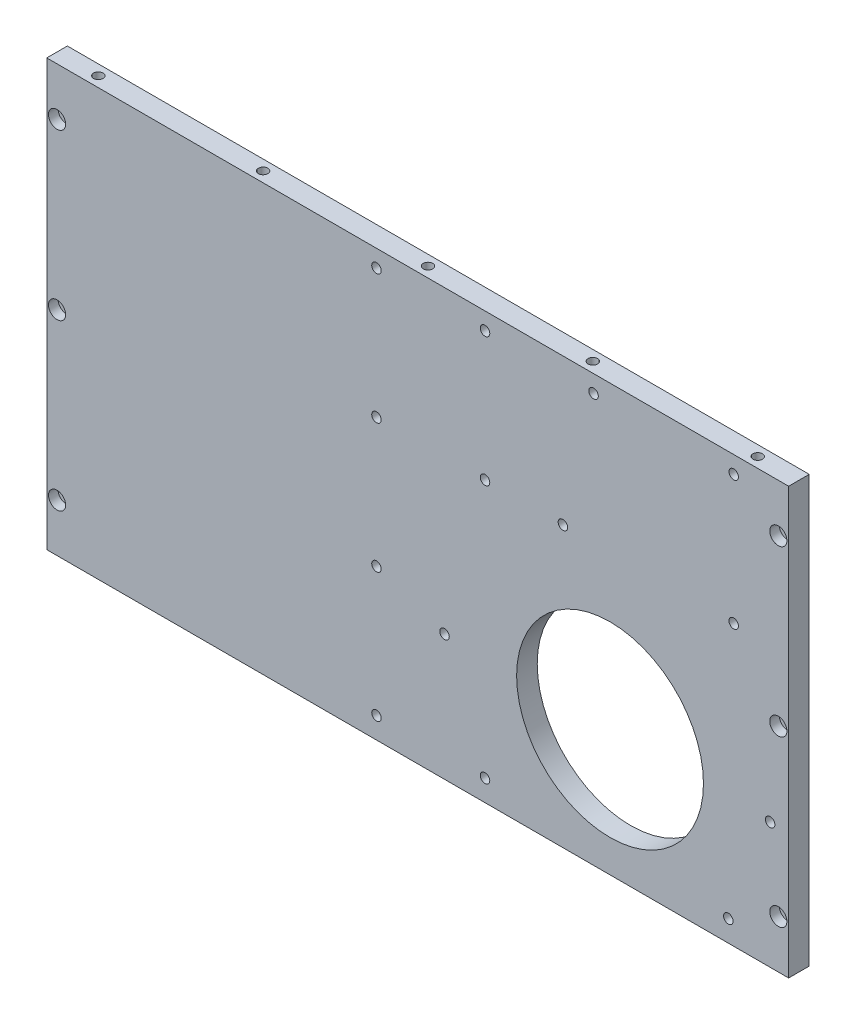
ISO-10303-21;
HEADER;
FILE_DESCRIPTION(('STEP AP214'),'2;1');
FILE_NAME('part.step','',(''),(''),'','','');
FILE_SCHEMA(('AUTOMOTIVE_DESIGN { 1 0 10303 214 1 1 1 1 }'));
ENDSEC;
DATA;
#1=APPLICATION_CONTEXT('core data for automotive mechanical design processes');
#2=APPLICATION_PROTOCOL_DEFINITION('international standard','automotive_design',2000,#1);
#3=PRODUCT_CONTEXT('',#1,'mechanical');
#4=PRODUCT('Part','Part','',(#3));
#5=PRODUCT_RELATED_PRODUCT_CATEGORY('part','',(#4));
#6=PRODUCT_DEFINITION_FORMATION('','',#4);
#7=PRODUCT_DEFINITION_CONTEXT('part definition',#1,'design');
#8=PRODUCT_DEFINITION('design','',#6,#7);
#9=PRODUCT_DEFINITION_SHAPE('','',#8);
#10=(LENGTH_UNIT() NAMED_UNIT(*) SI_UNIT(.MILLI.,.METRE.));
#11=(NAMED_UNIT(*) PLANE_ANGLE_UNIT() SI_UNIT($,.RADIAN.));
#12=(NAMED_UNIT(*) SI_UNIT($,.STERADIAN.) SOLID_ANGLE_UNIT());
#13=UNCERTAINTY_MEASURE_WITH_UNIT(LENGTH_MEASURE(1.E-05),#10,'distance_accuracy_value','');
#14=(GEOMETRIC_REPRESENTATION_CONTEXT(3) GLOBAL_UNCERTAINTY_ASSIGNED_CONTEXT((#13)) GLOBAL_UNIT_ASSIGNED_CONTEXT((#10,
#11,#12)) REPRESENTATION_CONTEXT('',''));
#15=CARTESIAN_POINT('',(0.,0.,0.));
#16=DIRECTION('',(0.,0.,1.));
#17=DIRECTION('',(1.,0.,0.));
#18=AXIS2_PLACEMENT_3D('',#15,#16,#17);
#19=CARTESIAN_POINT('',(171.45,98.425,9.525));
#20=DIRECTION('',(-1.,0.,0.));
#21=DIRECTION('',(0.,-1.,0.));
#22=AXIS2_PLACEMENT_3D('',#19,#20,#21);
#23=PLANE('',#22);
#24=DIRECTION('',(0.,1.,0.));
#25=VECTOR('',#24,1.);
#26=CARTESIAN_POINT('',(171.45,98.425,0.));
#27=LINE('',#26,#25);
#28=CARTESIAN_POINT('',(171.45,-98.425,0.));
#29=VERTEX_POINT('',#28);
#30=CARTESIAN_POINT('',(171.45,98.425,0.));
#31=VERTEX_POINT('',#30);
#32=EDGE_CURVE('E99',#29,#31,#27,.T.);
#33=ORIENTED_EDGE('',*,*,#32,.T.);
#34=DIRECTION('',(0.,0.,-1.));
#35=VECTOR('',#34,1.);
#36=CARTESIAN_POINT('',(171.45,98.425,9.525));
#37=LINE('',#36,#35);
#38=CARTESIAN_POINT('',(171.45,98.425,9.525));
#39=VERTEX_POINT('',#38);
#40=EDGE_CURVE('E11',#39,#31,#37,.T.);
#41=ORIENTED_EDGE('',*,*,#40,.F.);
#42=DIRECTION('',(0.,1.,0.));
#43=VECTOR('',#42,1.);
#44=CARTESIAN_POINT('',(171.45,98.425,9.525));
#45=LINE('',#44,#43);
#46=CARTESIAN_POINT('',(171.45,-98.425,9.525));
#47=VERTEX_POINT('',#46);
#48=EDGE_CURVE('E87',#47,#39,#45,.T.);
#49=ORIENTED_EDGE('',*,*,#48,.F.);
#50=DIRECTION('',(0.,0.,-1.));
#51=VECTOR('',#50,1.);
#52=CARTESIAN_POINT('',(171.45,-98.425,9.525));
#53=LINE('',#52,#51);
#54=EDGE_CURVE('E95',#47,#29,#53,.T.);
#55=ORIENTED_EDGE('',*,*,#54,.T.);
#56=EDGE_LOOP('',(#33,#41,#49,#55));
#57=FACE_BOUND('',#56,.T.);
#58=ADVANCED_FACE('F36',(#57),#23,.F.);
#59=CARTESIAN_POINT('',(-171.45,98.425,9.525));
#60=DIRECTION('',(0.,-1.,0.));
#61=DIRECTION('',(0.,0.,-1.));
#62=AXIS2_PLACEMENT_3D('',#59,#60,#61);
#63=PLANE('',#62);
#64=CARTESIAN_POINT('',(-152.4,98.425,4.76250000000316));
#65=DIRECTION('',(0.,1.,0.));
#66=DIRECTION('',(0.,0.,1.));
#67=AXIS2_PLACEMENT_3D('',#64,#65,#66);
#68=CIRCLE('',#67,2.1971);
#69=CARTESIAN_POINT('',(-152.4,98.425,6.95960000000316));
#70=VERTEX_POINT('',#69);
#71=EDGE_CURVE('E191',#70,#70,#68,.T.);
#72=ORIENTED_EDGE('',*,*,#71,.F.);
#73=EDGE_LOOP('',(#72));
#74=FACE_BOUND('',#73,.T.);
#75=CARTESIAN_POINT('',(-76.2,98.425,4.76250000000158));
#76=DIRECTION('',(0.,1.,0.));
#77=DIRECTION('',(0.,0.,1.));
#78=AXIS2_PLACEMENT_3D('',#75,#76,#77);
#79=CIRCLE('',#78,2.1971);
#80=CARTESIAN_POINT('',(-76.2,98.425,6.95960000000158));
#81=VERTEX_POINT('',#80);
#82=EDGE_CURVE('E198',#81,#81,#79,.T.);
#83=ORIENTED_EDGE('',*,*,#82,.F.);
#84=EDGE_LOOP('',(#83));
#85=FACE_BOUND('',#84,.T.);
#86=CARTESIAN_POINT('',(152.4,98.425,4.7625));
#87=DIRECTION('',(0.,1.,0.));
#88=DIRECTION('',(0.,0.,1.));
#89=AXIS2_PLACEMENT_3D('',#86,#87,#88);
#90=CIRCLE('',#89,2.1971);
#91=CARTESIAN_POINT('',(152.4,98.425,6.9596));
#92=VERTEX_POINT('',#91);
#93=EDGE_CURVE('E204',#92,#92,#90,.T.);
#94=ORIENTED_EDGE('',*,*,#93,.F.);
#95=EDGE_LOOP('',(#94));
#96=FACE_BOUND('',#95,.T.);
#97=CARTESIAN_POINT('',(76.2,98.425,4.7625));
#98=DIRECTION('',(0.,1.,0.));
#99=DIRECTION('',(0.,0.,1.));
#100=AXIS2_PLACEMENT_3D('',#97,#98,#99);
#101=CIRCLE('',#100,2.1971);
#102=CARTESIAN_POINT('',(76.2,98.425,6.9596));
#103=VERTEX_POINT('',#102);
#104=EDGE_CURVE('E210',#103,#103,#101,.T.);
#105=ORIENTED_EDGE('',*,*,#104,.F.);
#106=EDGE_LOOP('',(#105));
#107=FACE_BOUND('',#106,.T.);
#108=CARTESIAN_POINT('',(0.,98.425,4.7625));
#109=DIRECTION('',(0.,1.,0.));
#110=DIRECTION('',(0.,0.,1.));
#111=AXIS2_PLACEMENT_3D('',#108,#109,#110);
#112=CIRCLE('',#111,2.1971);
#113=CARTESIAN_POINT('',(0.,98.425,6.9596));
#114=VERTEX_POINT('',#113);
#115=EDGE_CURVE('E185',#114,#114,#112,.T.);
#116=ORIENTED_EDGE('',*,*,#115,.F.);
#117=EDGE_LOOP('',(#116));
#118=FACE_BOUND('',#117,.T.);
#119=DIRECTION('',(-1.,0.,0.));
#120=VECTOR('',#119,1.);
#121=CARTESIAN_POINT('',(-171.45,98.425,0.));
#122=LINE('',#121,#120);
#123=CARTESIAN_POINT('',(-171.45,98.425,0.));
#124=VERTEX_POINT('',#123);
#125=EDGE_CURVE('E91',#31,#124,#122,.T.);
#126=ORIENTED_EDGE('',*,*,#125,.T.);
#127=DIRECTION('',(0.,0.,-1.));
#128=VECTOR('',#127,1.);
#129=CARTESIAN_POINT('',(-171.45,98.425,9.525));
#130=LINE('',#129,#128);
#131=CARTESIAN_POINT('',(-171.45,98.425,9.525));
#132=VERTEX_POINT('',#131);
#133=EDGE_CURVE('E44',#132,#124,#130,.T.);
#134=ORIENTED_EDGE('',*,*,#133,.F.);
#135=DIRECTION('',(-1.,0.,0.));
#136=VECTOR('',#135,1.);
#137=CARTESIAN_POINT('',(-171.45,98.425,9.525));
#138=LINE('',#137,#136);
#139=EDGE_CURVE('E82',#39,#132,#138,.T.);
#140=ORIENTED_EDGE('',*,*,#139,.F.);
#141=ORIENTED_EDGE('',*,*,#40,.T.);
#142=EDGE_LOOP('',(#126,#134,#140,#141));
#143=FACE_BOUND('',#142,.T.);
#144=ADVANCED_FACE('F90',(#74,#85,#96,#107,#118,#143),#63,.F.);
#145=CARTESIAN_POINT('',(-171.45,98.425,9.525));
#146=DIRECTION('',(1.,0.,0.));
#147=DIRECTION('',(0.,0.,-1.));
#148=AXIS2_PLACEMENT_3D('',#145,#146,#147);
#149=PLANE('',#148);
#150=DIRECTION('',(0.,-1.,0.));
#151=VECTOR('',#150,1.);
#152=CARTESIAN_POINT('',(-171.45,98.425,0.));
#153=LINE('',#152,#151);
#154=CARTESIAN_POINT('',(-171.45,-98.425,0.));
#155=VERTEX_POINT('',#154);
#156=EDGE_CURVE('E69',#124,#155,#153,.T.);
#157=ORIENTED_EDGE('',*,*,#156,.T.);
#158=DIRECTION('',(0.,0.,-1.));
#159=VECTOR('',#158,1.);
#160=CARTESIAN_POINT('',(-171.45,-98.425,9.525));
#161=LINE('',#160,#159);
#162=CARTESIAN_POINT('',(-171.45,-98.425,9.525));
#163=VERTEX_POINT('',#162);
#164=EDGE_CURVE('E92',#163,#155,#161,.T.);
#165=ORIENTED_EDGE('',*,*,#164,.F.);
#166=DIRECTION('',(0.,-1.,0.));
#167=VECTOR('',#166,1.);
#168=CARTESIAN_POINT('',(-171.45,98.425,9.525));
#169=LINE('',#168,#167);
#170=EDGE_CURVE('E85',#132,#163,#169,.T.);
#171=ORIENTED_EDGE('',*,*,#170,.F.);
#172=ORIENTED_EDGE('',*,*,#133,.T.);
#173=EDGE_LOOP('',(#157,#165,#171,#172));
#174=FACE_BOUND('',#173,.T.);
#175=ADVANCED_FACE('F93',(#174),#149,.F.);
#176=CARTESIAN_POINT('',(-171.45,-98.425,9.525));
#177=DIRECTION('',(0.,1.,0.));
#178=DIRECTION('',(0.,0.,1.));
#179=AXIS2_PLACEMENT_3D('',#176,#177,#178);
#180=PLANE('',#179);
#181=CARTESIAN_POINT('',(-152.4,-98.425,4.76249999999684));
#182=DIRECTION('',(0.,-1.,0.));
#183=DIRECTION('',(0.,0.,-1.));
#184=AXIS2_PLACEMENT_3D('',#181,#182,#183);
#185=CIRCLE('',#184,2.1971);
#186=CARTESIAN_POINT('',(-152.4,-98.425,2.56539999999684));
#187=VERTEX_POINT('',#186);
#188=EDGE_CURVE('E221',#187,#187,#185,.T.);
#189=ORIENTED_EDGE('',*,*,#188,.F.);
#190=EDGE_LOOP('',(#189));
#191=FACE_BOUND('',#190,.T.);
#192=CARTESIAN_POINT('',(-76.2,-98.425,4.76249999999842));
#193=DIRECTION('',(0.,-1.,0.));
#194=DIRECTION('',(0.,0.,-1.));
#195=AXIS2_PLACEMENT_3D('',#192,#193,#194);
#196=CIRCLE('',#195,2.1971);
#197=CARTESIAN_POINT('',(-76.2,-98.425,2.56539999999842));
#198=VERTEX_POINT('',#197);
#199=EDGE_CURVE('E228',#198,#198,#196,.T.);
#200=ORIENTED_EDGE('',*,*,#199,.F.);
#201=EDGE_LOOP('',(#200));
#202=FACE_BOUND('',#201,.T.);
#203=CARTESIAN_POINT('',(152.4,-98.425,4.7625));
#204=DIRECTION('',(0.,-1.,0.));
#205=DIRECTION('',(0.,0.,-1.));
#206=AXIS2_PLACEMENT_3D('',#203,#204,#205);
#207=CIRCLE('',#206,2.1971);
#208=CARTESIAN_POINT('',(152.4,-98.425,2.5654));
#209=VERTEX_POINT('',#208);
#210=EDGE_CURVE('E234',#209,#209,#207,.T.);
#211=ORIENTED_EDGE('',*,*,#210,.F.);
#212=EDGE_LOOP('',(#211));
#213=FACE_BOUND('',#212,.T.);
#214=CARTESIAN_POINT('',(76.2,-98.425,4.7625));
#215=DIRECTION('',(0.,-1.,0.));
#216=DIRECTION('',(0.,0.,-1.));
#217=AXIS2_PLACEMENT_3D('',#214,#215,#216);
#218=CIRCLE('',#217,2.1971);
#219=CARTESIAN_POINT('',(76.2,-98.425,2.5654));
#220=VERTEX_POINT('',#219);
#221=EDGE_CURVE('E240',#220,#220,#218,.T.);
#222=ORIENTED_EDGE('',*,*,#221,.F.);
#223=EDGE_LOOP('',(#222));
#224=FACE_BOUND('',#223,.T.);
#225=CARTESIAN_POINT('',(0.,-98.425,4.7625));
#226=DIRECTION('',(0.,-1.,0.));
#227=DIRECTION('',(0.,0.,-1.));
#228=AXIS2_PLACEMENT_3D('',#225,#226,#227);
#229=CIRCLE('',#228,2.1971);
#230=CARTESIAN_POINT('',(0.,-98.425,2.5654));
#231=VERTEX_POINT('',#230);
#232=EDGE_CURVE('E215',#231,#231,#229,.T.);
#233=ORIENTED_EDGE('',*,*,#232,.F.);
#234=EDGE_LOOP('',(#233));
#235=FACE_BOUND('',#234,.T.);
#236=DIRECTION('',(1.,0.,0.));
#237=VECTOR('',#236,1.);
#238=CARTESIAN_POINT('',(-171.45,-98.425,0.));
#239=LINE('',#238,#237);
#240=EDGE_CURVE('E75',#155,#29,#239,.T.);
#241=ORIENTED_EDGE('',*,*,#240,.T.);
#242=ORIENTED_EDGE('',*,*,#54,.F.);
#243=DIRECTION('',(1.,0.,0.));
#244=VECTOR('',#243,1.);
#245=CARTESIAN_POINT('',(-171.45,-98.425,9.525));
#246=LINE('',#245,#244);
#247=EDGE_CURVE('E52',#163,#47,#246,.T.);
#248=ORIENTED_EDGE('',*,*,#247,.F.);
#249=ORIENTED_EDGE('',*,*,#164,.T.);
#250=EDGE_LOOP('',(#241,#242,#248,#249));
#251=FACE_BOUND('',#250,.T.);
#252=ADVANCED_FACE('F107',(#191,#202,#213,#224,#235,#251),#180,.F.);
#253=CARTESIAN_POINT('',(0.,0.,9.525));
#254=DIRECTION('',(0.,0.,1.));
#255=DIRECTION('',(1.,0.,0.));
#256=AXIS2_PLACEMENT_3D('',#253,#254,#255);
#257=PLANE('',#256);
#258=CARTESIAN_POINT('',(12.389816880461,-40.2844000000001,9.525));
#259=DIRECTION('',(0.,0.,1.));
#260=DIRECTION('',(1.,0.,0.));
#261=AXIS2_PLACEMENT_3D('',#258,#259,#260);
#262=CIRCLE('',#261,2.1971);
#263=CARTESIAN_POINT('',(14.586916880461,-40.2844000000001,9.525));
#264=VERTEX_POINT('',#263);
#265=EDGE_CURVE('E281',#264,#264,#262,.T.);
#266=ORIENTED_EDGE('',*,*,#265,.F.);
#267=EDGE_LOOP('',(#266));
#268=FACE_BOUND('',#267,.T.);
#269=CARTESIAN_POINT('',(-19.0500000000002,-28.8924999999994,9.525));
#270=DIRECTION('',(0.,0.,1.));
#271=DIRECTION('',(1.,0.,0.));
#272=AXIS2_PLACEMENT_3D('',#269,#270,#271);
#273=CIRCLE('',#272,2.1971);
#274=CARTESIAN_POINT('',(-16.8529000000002,-28.8924999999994,9.525));
#275=VERTEX_POINT('',#274);
#276=EDGE_CURVE('E288',#275,#275,#273,.T.);
#277=ORIENTED_EDGE('',*,*,#276,.F.);
#278=EDGE_LOOP('',(#277));
#279=FACE_BOUND('',#278,.T.);
#280=CARTESIAN_POINT('',(-19.05,30.7975000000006,9.525));
#281=DIRECTION('',(0.,0.,1.));
#282=DIRECTION('',(1.,0.,0.));
#283=AXIS2_PLACEMENT_3D('',#280,#281,#282);
#284=CIRCLE('',#283,2.1971);
#285=CARTESIAN_POINT('',(-16.8529,30.7975000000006,9.525));
#286=VERTEX_POINT('',#285);
#287=EDGE_CURVE('E294',#286,#286,#284,.T.);
#288=ORIENTED_EDGE('',*,*,#287,.F.);
#289=EDGE_LOOP('',(#288));
#290=FACE_BOUND('',#289,.T.);
#291=CARTESIAN_POINT('',(31.115,30.7975000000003,9.525));
#292=DIRECTION('',(0.,0.,1.));
#293=DIRECTION('',(1.,0.,0.));
#294=AXIS2_PLACEMENT_3D('',#291,#292,#293);
#295=CIRCLE('',#294,2.1971);
#296=CARTESIAN_POINT('',(33.3121,30.7975000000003,9.525));
#297=VERTEX_POINT('',#296);
#298=EDGE_CURVE('E300',#297,#297,#295,.T.);
#299=ORIENTED_EDGE('',*,*,#298,.F.);
#300=EDGE_LOOP('',(#299));
#301=FACE_BOUND('',#300,.T.);
#302=CARTESIAN_POINT('',(31.1150000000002,90.4875000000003,9.525));
#303=DIRECTION('',(0.,0.,1.));
#304=DIRECTION('',(1.,0.,0.));
#305=AXIS2_PLACEMENT_3D('',#302,#303,#304);
#306=CIRCLE('',#305,2.1971);
#307=CARTESIAN_POINT('',(33.3121000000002,90.4875000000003,9.525));
#308=VERTEX_POINT('',#307);
#309=EDGE_CURVE('E264',#308,#308,#306,.T.);
#310=ORIENTED_EDGE('',*,*,#309,.F.);
#311=EDGE_LOOP('',(#310));
#312=FACE_BOUND('',#311,.T.);
#313=CARTESIAN_POINT('',(81.2800000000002,90.4874999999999,9.525));
#314=DIRECTION('',(0.,0.,1.));
#315=DIRECTION('',(1.,0.,0.));
#316=AXIS2_PLACEMENT_3D('',#313,#314,#315);
#317=CIRCLE('',#316,2.1971);
#318=CARTESIAN_POINT('',(83.4771000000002,90.4874999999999,9.525));
#319=VERTEX_POINT('',#318);
#320=EDGE_CURVE('E257',#319,#319,#317,.T.);
#321=ORIENTED_EDGE('',*,*,#320,.F.);
#322=EDGE_LOOP('',(#321));
#323=FACE_BOUND('',#322,.T.);
#324=CARTESIAN_POINT('',(146.05,90.4874999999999,9.525));
#325=DIRECTION('',(0.,0.,1.));
#326=DIRECTION('',(1.,0.,0.));
#327=AXIS2_PLACEMENT_3D('',#324,#325,#326);
#328=CIRCLE('',#327,2.1971);
#329=CARTESIAN_POINT('',(148.2471,90.4874999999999,9.525));
#330=VERTEX_POINT('',#329);
#331=EDGE_CURVE('E276',#330,#330,#328,.T.);
#332=ORIENTED_EDGE('',*,*,#331,.F.);
#333=EDGE_LOOP('',(#332));
#334=FACE_BOUND('',#333,.T.);
#335=CARTESIAN_POINT('',(67.1211795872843,30.7975000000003,9.525));
#336=DIRECTION('',(0.,0.,1.));
#337=DIRECTION('',(1.,0.,0.));
#338=AXIS2_PLACEMENT_3D('',#335,#336,#337);
#339=CIRCLE('',#338,2.1971);
#340=CARTESIAN_POINT('',(69.3182795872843,30.7975000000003,9.525));
#341=VERTEX_POINT('',#340);
#342=EDGE_CURVE('E269',#341,#341,#339,.T.);
#343=ORIENTED_EDGE('',*,*,#342,.F.);
#344=EDGE_LOOP('',(#343));
#345=FACE_BOUND('',#344,.T.);
#346=CARTESIAN_POINT('',(143.566615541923,-88.5824999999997,9.525));
#347=DIRECTION('',(0.,0.,1.));
#348=DIRECTION('',(1.,0.,0.));
#349=AXIS2_PLACEMENT_3D('',#346,#347,#348);
#350=CIRCLE('',#349,2.1971);
#351=CARTESIAN_POINT('',(145.763715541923,-88.5824999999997,9.525));
#352=VERTEX_POINT('',#351);
#353=EDGE_CURVE('E329',#352,#352,#350,.T.);
#354=ORIENTED_EDGE('',*,*,#353,.F.);
#355=EDGE_LOOP('',(#354));
#356=FACE_BOUND('',#355,.T.);
#357=CARTESIAN_POINT('',(162.901064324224,-40.2844000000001,9.525));
#358=DIRECTION('',(0.,0.,1.));
#359=DIRECTION('',(1.,0.,0.));
#360=AXIS2_PLACEMENT_3D('',#357,#358,#359);
#361=CIRCLE('',#360,2.1971);
#362=CARTESIAN_POINT('',(165.098164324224,-40.2844000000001,9.525));
#363=VERTEX_POINT('',#362);
#364=EDGE_CURVE('E305',#363,#363,#361,.T.);
#365=ORIENTED_EDGE('',*,*,#364,.F.);
#366=EDGE_LOOP('',(#365));
#367=FACE_BOUND('',#366,.T.);
#368=CARTESIAN_POINT('',(146.05,30.7974999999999,9.525));
#369=DIRECTION('',(0.,0.,1.));
#370=DIRECTION('',(1.,0.,0.));
#371=AXIS2_PLACEMENT_3D('',#368,#369,#370);
#372=CIRCLE('',#371,2.1971);
#373=CARTESIAN_POINT('',(148.2471,30.7974999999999,9.525));
#374=VERTEX_POINT('',#373);
#375=EDGE_CURVE('E312',#374,#374,#372,.T.);
#376=ORIENTED_EDGE('',*,*,#375,.F.);
#377=EDGE_LOOP('',(#376));
#378=FACE_BOUND('',#377,.T.);
#379=CARTESIAN_POINT('',(31.1149999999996,-88.5824999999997,9.525));
#380=DIRECTION('',(0.,0.,1.));
#381=DIRECTION('',(1.,0.,0.));
#382=AXIS2_PLACEMENT_3D('',#379,#380,#381);
#383=CIRCLE('',#382,2.1971);
#384=CARTESIAN_POINT('',(33.3120999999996,-88.5824999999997,9.525));
#385=VERTEX_POINT('',#384);
#386=EDGE_CURVE('E318',#385,#385,#383,.T.);
#387=ORIENTED_EDGE('',*,*,#386,.F.);
#388=EDGE_LOOP('',(#387));
#389=FACE_BOUND('',#388,.T.);
#390=CARTESIAN_POINT('',(-19.0500000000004,-88.5824999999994,9.525));
#391=DIRECTION('',(0.,0.,1.));
#392=DIRECTION('',(1.,0.,0.));
#393=AXIS2_PLACEMENT_3D('',#390,#391,#392);
#394=CIRCLE('',#393,2.1971);
#395=CARTESIAN_POINT('',(-16.8529000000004,-88.5824999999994,9.525));
#396=VERTEX_POINT('',#395);
#397=EDGE_CURVE('E324',#396,#396,#394,.T.);
#398=ORIENTED_EDGE('',*,*,#397,.F.);
#399=EDGE_LOOP('',(#398));
#400=FACE_BOUND('',#399,.T.);
#401=CARTESIAN_POINT('',(-19.0499999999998,90.4874999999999,9.525));
#402=DIRECTION('',(0.,0.,1.));
#403=DIRECTION('',(1.,0.,0.));
#404=AXIS2_PLACEMENT_3D('',#401,#402,#403);
#405=CIRCLE('',#404,2.1971);
#406=CARTESIAN_POINT('',(-16.8528999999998,90.4874999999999,9.525));
#407=VERTEX_POINT('',#406);
#408=EDGE_CURVE('E251',#407,#407,#405,.T.);
#409=ORIENTED_EDGE('',*,*,#408,.F.);
#410=EDGE_LOOP('',(#409));
#411=FACE_BOUND('',#410,.T.);
#412=CARTESIAN_POINT('',(88.9000000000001,-40.2844000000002,9.525));
#413=DIRECTION('',(0.,0.,1.));
#414=DIRECTION('',(1.,0.,0.));
#415=AXIS2_PLACEMENT_3D('',#412,#413,#414);
#416=CIRCLE('',#415,43.18);
#417=CARTESIAN_POINT('',(132.08,-40.2844000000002,9.525));
#418=VERTEX_POINT('',#417);
#419=EDGE_CURVE('E245',#418,#418,#416,.T.);
#420=ORIENTED_EDGE('',*,*,#419,.F.);
#421=EDGE_LOOP('',(#420));
#422=FACE_BOUND('',#421,.T.);
#423=CARTESIAN_POINT('',(-166.6875,76.2,9.525));
#424=DIRECTION('',(0.,0.,1.));
#425=DIRECTION('',(1.,0.,0.));
#426=AXIS2_PLACEMENT_3D('',#423,#424,#425);
#427=CIRCLE('',#426,3.96875000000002);
#428=CARTESIAN_POINT('',(-162.71875,76.2,9.525));
#429=VERTEX_POINT('',#428);
#430=EDGE_CURVE('E181',#429,#429,#427,.T.);
#431=ORIENTED_EDGE('',*,*,#430,.F.);
#432=EDGE_LOOP('',(#431));
#433=FACE_BOUND('',#432,.T.);
#434=CARTESIAN_POINT('',(-166.6875,0.,9.525));
#435=DIRECTION('',(0.,0.,1.));
#436=DIRECTION('',(1.,0.,0.));
#437=AXIS2_PLACEMENT_3D('',#434,#435,#436);
#438=CIRCLE('',#437,3.96875000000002);
#439=CARTESIAN_POINT('',(-162.71875,0.,9.525));
#440=VERTEX_POINT('',#439);
#441=EDGE_CURVE('E169',#440,#440,#438,.T.);
#442=ORIENTED_EDGE('',*,*,#441,.F.);
#443=EDGE_LOOP('',(#442));
#444=FACE_BOUND('',#443,.T.);
#445=CARTESIAN_POINT('',(-166.687499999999,-76.2,9.525));
#446=DIRECTION('',(0.,0.,1.));
#447=DIRECTION('',(1.,0.,0.));
#448=AXIS2_PLACEMENT_3D('',#445,#446,#447);
#449=CIRCLE('',#448,3.96875000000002);
#450=CARTESIAN_POINT('',(-162.718749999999,-76.2,9.525));
#451=VERTEX_POINT('',#450);
#452=EDGE_CURVE('E157',#451,#451,#449,.T.);
#453=ORIENTED_EDGE('',*,*,#452,.F.);
#454=EDGE_LOOP('',(#453));
#455=FACE_BOUND('',#454,.T.);
#456=CARTESIAN_POINT('',(166.6875,76.2,9.525));
#457=DIRECTION('',(0.,0.,1.));
#458=DIRECTION('',(1.,0.,0.));
#459=AXIS2_PLACEMENT_3D('',#456,#457,#458);
#460=CIRCLE('',#459,3.96875000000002);
#461=CARTESIAN_POINT('',(170.65625,76.2,9.525));
#462=VERTEX_POINT('',#461);
#463=EDGE_CURVE('E145',#462,#462,#460,.T.);
#464=ORIENTED_EDGE('',*,*,#463,.F.);
#465=EDGE_LOOP('',(#464));
#466=FACE_BOUND('',#465,.T.);
#467=CARTESIAN_POINT('',(166.6875,0.,9.525));
#468=DIRECTION('',(0.,0.,1.));
#469=DIRECTION('',(1.,0.,0.));
#470=AXIS2_PLACEMENT_3D('',#467,#468,#469);
#471=CIRCLE('',#470,3.96875000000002);
#472=CARTESIAN_POINT('',(170.65625,0.,9.525));
#473=VERTEX_POINT('',#472);
#474=EDGE_CURVE('E133',#473,#473,#471,.T.);
#475=ORIENTED_EDGE('',*,*,#474,.F.);
#476=EDGE_LOOP('',(#475));
#477=FACE_BOUND('',#476,.T.);
#478=CARTESIAN_POINT('',(166.687499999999,-76.2,9.525));
#479=DIRECTION('',(0.,0.,1.));
#480=DIRECTION('',(1.,0.,0.));
#481=AXIS2_PLACEMENT_3D('',#478,#479,#480);
#482=CIRCLE('',#481,3.96875000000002);
#483=CARTESIAN_POINT('',(170.656249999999,-76.2,9.525));
#484=VERTEX_POINT('',#483);
#485=EDGE_CURVE('E121',#484,#484,#482,.T.);
#486=ORIENTED_EDGE('',*,*,#485,.F.);
#487=EDGE_LOOP('',(#486));
#488=FACE_BOUND('',#487,.T.);
#489=ORIENTED_EDGE('',*,*,#48,.T.);
#490=ORIENTED_EDGE('',*,*,#139,.T.);
#491=ORIENTED_EDGE('',*,*,#170,.T.);
#492=ORIENTED_EDGE('',*,*,#247,.T.);
#493=EDGE_LOOP('',(#489,#490,#491,#492));
#494=FACE_BOUND('',#493,.T.);
#495=ADVANCED_FACE('F83',(#268,#279,#290,#301,#312,#323,#334,#345,#356,#367,#378,#389,#400,#411,
#422,#433,#444,#455,#466,#477,#488,#494),#257,.T.);
#496=CARTESIAN_POINT('',(0.,0.,0.));
#497=DIRECTION('',(0.,0.,1.));
#498=DIRECTION('',(1.,0.,0.));
#499=AXIS2_PLACEMENT_3D('',#496,#497,#498);
#500=PLANE('',#499);
#501=CARTESIAN_POINT('',(12.389816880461,-40.2844000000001,0.));
#502=DIRECTION('',(0.,0.,1.));
#503=DIRECTION('',(1.,0.,0.));
#504=AXIS2_PLACEMENT_3D('',#501,#502,#503);
#505=CIRCLE('',#504,2.1971);
#506=CARTESIAN_POINT('',(14.586916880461,-40.2844000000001,0.));
#507=VERTEX_POINT('',#506);
#508=EDGE_CURVE('E284',#507,#507,#505,.T.);
#509=ORIENTED_EDGE('',*,*,#508,.T.);
#510=EDGE_LOOP('',(#509));
#511=FACE_BOUND('',#510,.T.);
#512=CARTESIAN_POINT('',(-19.0500000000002,-28.8924999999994,0.));
#513=DIRECTION('',(0.,0.,1.));
#514=DIRECTION('',(1.,0.,0.));
#515=AXIS2_PLACEMENT_3D('',#512,#513,#514);
#516=CIRCLE('',#515,2.1971);
#517=CARTESIAN_POINT('',(-16.8529000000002,-28.8924999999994,0.));
#518=VERTEX_POINT('',#517);
#519=EDGE_CURVE('E291',#518,#518,#516,.T.);
#520=ORIENTED_EDGE('',*,*,#519,.T.);
#521=EDGE_LOOP('',(#520));
#522=FACE_BOUND('',#521,.T.);
#523=CARTESIAN_POINT('',(-19.05,30.7975000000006,0.));
#524=DIRECTION('',(0.,0.,1.));
#525=DIRECTION('',(1.,0.,0.));
#526=AXIS2_PLACEMENT_3D('',#523,#524,#525);
#527=CIRCLE('',#526,2.1971);
#528=CARTESIAN_POINT('',(-16.8529,30.7975000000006,0.));
#529=VERTEX_POINT('',#528);
#530=EDGE_CURVE('E297',#529,#529,#527,.T.);
#531=ORIENTED_EDGE('',*,*,#530,.T.);
#532=EDGE_LOOP('',(#531));
#533=FACE_BOUND('',#532,.T.);
#534=CARTESIAN_POINT('',(31.115,30.7975000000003,0.));
#535=DIRECTION('',(0.,0.,1.));
#536=DIRECTION('',(1.,0.,0.));
#537=AXIS2_PLACEMENT_3D('',#534,#535,#536);
#538=CIRCLE('',#537,2.1971);
#539=CARTESIAN_POINT('',(33.3121,30.7975000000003,0.));
#540=VERTEX_POINT('',#539);
#541=EDGE_CURVE('E273',#540,#540,#538,.T.);
#542=ORIENTED_EDGE('',*,*,#541,.T.);
#543=EDGE_LOOP('',(#542));
#544=FACE_BOUND('',#543,.T.);
#545=CARTESIAN_POINT('',(31.1150000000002,90.4875000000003,0.));
#546=DIRECTION('',(0.,0.,1.));
#547=DIRECTION('',(1.,0.,0.));
#548=AXIS2_PLACEMENT_3D('',#545,#546,#547);
#549=CIRCLE('',#548,2.1971);
#550=CARTESIAN_POINT('',(33.3121000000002,90.4875000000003,0.));
#551=VERTEX_POINT('',#550);
#552=EDGE_CURVE('E254',#551,#551,#549,.T.);
#553=ORIENTED_EDGE('',*,*,#552,.T.);
#554=EDGE_LOOP('',(#553));
#555=FACE_BOUND('',#554,.T.);
#556=CARTESIAN_POINT('',(81.2800000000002,90.4874999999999,0.));
#557=DIRECTION('',(0.,0.,1.));
#558=DIRECTION('',(1.,0.,0.));
#559=AXIS2_PLACEMENT_3D('',#556,#557,#558);
#560=CIRCLE('',#559,2.1971);
#561=CARTESIAN_POINT('',(83.4771000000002,90.4874999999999,0.));
#562=VERTEX_POINT('',#561);
#563=EDGE_CURVE('E260',#562,#562,#560,.T.);
#564=ORIENTED_EDGE('',*,*,#563,.T.);
#565=EDGE_LOOP('',(#564));
#566=FACE_BOUND('',#565,.T.);
#567=CARTESIAN_POINT('',(146.05,90.4874999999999,0.));
#568=DIRECTION('',(0.,0.,1.));
#569=DIRECTION('',(1.,0.,0.));
#570=AXIS2_PLACEMENT_3D('',#567,#568,#569);
#571=CIRCLE('',#570,2.1971);
#572=CARTESIAN_POINT('',(148.2471,90.4874999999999,0.));
#573=VERTEX_POINT('',#572);
#574=EDGE_CURVE('E261',#573,#573,#571,.T.);
#575=ORIENTED_EDGE('',*,*,#574,.T.);
#576=EDGE_LOOP('',(#575));
#577=FACE_BOUND('',#576,.T.);
#578=CARTESIAN_POINT('',(67.1211795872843,30.7975000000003,0.));
#579=DIRECTION('',(0.,0.,1.));
#580=DIRECTION('',(1.,0.,0.));
#581=AXIS2_PLACEMENT_3D('',#578,#579,#580);
#582=CIRCLE('',#581,2.1971);
#583=CARTESIAN_POINT('',(69.3182795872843,30.7975000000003,0.));
#584=VERTEX_POINT('',#583);
#585=EDGE_CURVE('E272',#584,#584,#582,.T.);
#586=ORIENTED_EDGE('',*,*,#585,.T.);
#587=EDGE_LOOP('',(#586));
#588=FACE_BOUND('',#587,.T.);
#589=CARTESIAN_POINT('',(143.566615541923,-88.5824999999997,0.));
#590=DIRECTION('',(0.,0.,1.));
#591=DIRECTION('',(1.,0.,0.));
#592=AXIS2_PLACEMENT_3D('',#589,#590,#591);
#593=CIRCLE('',#592,2.1971);
#594=CARTESIAN_POINT('',(145.763715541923,-88.5824999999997,0.));
#595=VERTEX_POINT('',#594);
#596=EDGE_CURVE('E309',#595,#595,#593,.T.);
#597=ORIENTED_EDGE('',*,*,#596,.T.);
#598=EDGE_LOOP('',(#597));
#599=FACE_BOUND('',#598,.T.);
#600=CARTESIAN_POINT('',(162.901064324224,-40.2844000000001,0.));
#601=DIRECTION('',(0.,0.,1.));
#602=DIRECTION('',(1.,0.,0.));
#603=AXIS2_PLACEMENT_3D('',#600,#601,#602);
#604=CIRCLE('',#603,2.1971);
#605=CARTESIAN_POINT('',(165.098164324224,-40.2844000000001,0.));
#606=VERTEX_POINT('',#605);
#607=EDGE_CURVE('E308',#606,#606,#604,.T.);
#608=ORIENTED_EDGE('',*,*,#607,.T.);
#609=EDGE_LOOP('',(#608));
#610=FACE_BOUND('',#609,.T.);
#611=CARTESIAN_POINT('',(146.05,30.7974999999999,0.));
#612=DIRECTION('',(0.,0.,1.));
#613=DIRECTION('',(1.,0.,0.));
#614=AXIS2_PLACEMENT_3D('',#611,#612,#613);
#615=CIRCLE('',#614,2.1971);
#616=CARTESIAN_POINT('',(148.2471,30.7974999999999,0.));
#617=VERTEX_POINT('',#616);
#618=EDGE_CURVE('E315',#617,#617,#615,.T.);
#619=ORIENTED_EDGE('',*,*,#618,.T.);
#620=EDGE_LOOP('',(#619));
#621=FACE_BOUND('',#620,.T.);
#622=CARTESIAN_POINT('',(31.1149999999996,-88.5824999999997,0.));
#623=DIRECTION('',(0.,0.,1.));
#624=DIRECTION('',(1.,0.,0.));
#625=AXIS2_PLACEMENT_3D('',#622,#623,#624);
#626=CIRCLE('',#625,2.1971);
#627=CARTESIAN_POINT('',(33.3120999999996,-88.5824999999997,0.));
#628=VERTEX_POINT('',#627);
#629=EDGE_CURVE('E321',#628,#628,#626,.T.);
#630=ORIENTED_EDGE('',*,*,#629,.T.);
#631=EDGE_LOOP('',(#630));
#632=FACE_BOUND('',#631,.T.);
#633=CARTESIAN_POINT('',(-19.0500000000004,-88.5824999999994,0.));
#634=DIRECTION('',(0.,0.,1.));
#635=DIRECTION('',(1.,0.,0.));
#636=AXIS2_PLACEMENT_3D('',#633,#634,#635);
#637=CIRCLE('',#636,2.1971);
#638=CARTESIAN_POINT('',(-16.8529000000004,-88.5824999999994,0.));
#639=VERTEX_POINT('',#638);
#640=EDGE_CURVE('E285',#639,#639,#637,.T.);
#641=ORIENTED_EDGE('',*,*,#640,.T.);
#642=EDGE_LOOP('',(#641));
#643=FACE_BOUND('',#642,.T.);
#644=CARTESIAN_POINT('',(-19.0499999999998,90.4874999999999,0.));
#645=DIRECTION('',(0.,0.,1.));
#646=DIRECTION('',(1.,0.,0.));
#647=AXIS2_PLACEMENT_3D('',#644,#645,#646);
#648=CIRCLE('',#647,2.1971);
#649=CARTESIAN_POINT('',(-16.8528999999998,90.4874999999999,0.));
#650=VERTEX_POINT('',#649);
#651=EDGE_CURVE('E248',#650,#650,#648,.T.);
#652=ORIENTED_EDGE('',*,*,#651,.T.);
#653=EDGE_LOOP('',(#652));
#654=FACE_BOUND('',#653,.T.);
#655=CARTESIAN_POINT('',(88.9000000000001,-40.2844000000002,0.));
#656=DIRECTION('',(0.,0.,1.));
#657=DIRECTION('',(1.,0.,0.));
#658=AXIS2_PLACEMENT_3D('',#655,#656,#657);
#659=CIRCLE('',#658,43.18);
#660=CARTESIAN_POINT('',(132.08,-40.2844000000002,0.));
#661=VERTEX_POINT('',#660);
#662=EDGE_CURVE('E225',#661,#661,#659,.T.);
#663=ORIENTED_EDGE('',*,*,#662,.T.);
#664=EDGE_LOOP('',(#663));
#665=FACE_BOUND('',#664,.T.);
#666=CARTESIAN_POINT('',(-166.6875,76.2,0.));
#667=DIRECTION('',(0.,0.,1.));
#668=DIRECTION('',(1.,0.,0.));
#669=AXIS2_PLACEMENT_3D('',#666,#667,#668);
#670=CIRCLE('',#669,2.15264999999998);
#671=CARTESIAN_POINT('',(-164.53485,76.2,0.));
#672=VERTEX_POINT('',#671);
#673=EDGE_CURVE('E172',#672,#672,#670,.T.);
#674=ORIENTED_EDGE('',*,*,#673,.T.);
#675=EDGE_LOOP('',(#674));
#676=FACE_BOUND('',#675,.T.);
#677=CARTESIAN_POINT('',(-166.6875,0.,0.));
#678=DIRECTION('',(0.,0.,1.));
#679=DIRECTION('',(1.,0.,0.));
#680=AXIS2_PLACEMENT_3D('',#677,#678,#679);
#681=CIRCLE('',#680,2.15264999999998);
#682=CARTESIAN_POINT('',(-164.53485,0.,0.));
#683=VERTEX_POINT('',#682);
#684=EDGE_CURVE('E160',#683,#683,#681,.T.);
#685=ORIENTED_EDGE('',*,*,#684,.T.);
#686=EDGE_LOOP('',(#685));
#687=FACE_BOUND('',#686,.T.);
#688=CARTESIAN_POINT('',(-166.687499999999,-76.2,0.));
#689=DIRECTION('',(0.,0.,1.));
#690=DIRECTION('',(1.,0.,0.));
#691=AXIS2_PLACEMENT_3D('',#688,#689,#690);
#692=CIRCLE('',#691,2.15264999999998);
#693=CARTESIAN_POINT('',(-164.534849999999,-76.2,0.));
#694=VERTEX_POINT('',#693);
#695=EDGE_CURVE('E148',#694,#694,#692,.T.);
#696=ORIENTED_EDGE('',*,*,#695,.T.);
#697=EDGE_LOOP('',(#696));
#698=FACE_BOUND('',#697,.T.);
#699=CARTESIAN_POINT('',(166.6875,76.2,0.));
#700=DIRECTION('',(0.,0.,1.));
#701=DIRECTION('',(1.,0.,0.));
#702=AXIS2_PLACEMENT_3D('',#699,#700,#701);
#703=CIRCLE('',#702,2.15264999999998);
#704=CARTESIAN_POINT('',(168.84015,76.2,0.));
#705=VERTEX_POINT('',#704);
#706=EDGE_CURVE('E136',#705,#705,#703,.T.);
#707=ORIENTED_EDGE('',*,*,#706,.T.);
#708=EDGE_LOOP('',(#707));
#709=FACE_BOUND('',#708,.T.);
#710=CARTESIAN_POINT('',(166.6875,0.,0.));
#711=DIRECTION('',(0.,0.,1.));
#712=DIRECTION('',(1.,0.,0.));
#713=AXIS2_PLACEMENT_3D('',#710,#711,#712);
#714=CIRCLE('',#713,2.15264999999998);
#715=CARTESIAN_POINT('',(168.84015,0.,0.));
#716=VERTEX_POINT('',#715);
#717=EDGE_CURVE('E124',#716,#716,#714,.T.);
#718=ORIENTED_EDGE('',*,*,#717,.T.);
#719=EDGE_LOOP('',(#718));
#720=FACE_BOUND('',#719,.T.);
#721=CARTESIAN_POINT('',(166.687499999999,-76.2,0.));
#722=DIRECTION('',(0.,0.,1.));
#723=DIRECTION('',(1.,0.,0.));
#724=AXIS2_PLACEMENT_3D('',#721,#722,#723);
#725=CIRCLE('',#724,2.15264999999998);
#726=CARTESIAN_POINT('',(168.840149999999,-76.2,0.));
#727=VERTEX_POINT('',#726);
#728=EDGE_CURVE('E102',#727,#727,#725,.T.);
#729=ORIENTED_EDGE('',*,*,#728,.T.);
#730=EDGE_LOOP('',(#729));
#731=FACE_BOUND('',#730,.T.);
#732=ORIENTED_EDGE('',*,*,#32,.F.);
#733=ORIENTED_EDGE('',*,*,#240,.F.);
#734=ORIENTED_EDGE('',*,*,#156,.F.);
#735=ORIENTED_EDGE('',*,*,#125,.F.);
#736=EDGE_LOOP('',(#732,#733,#734,#735));
#737=FACE_BOUND('',#736,.T.);
#738=ADVANCED_FACE('F110',(#511,#522,#533,#544,#555,#566,#577,#588,#599,#610,#621,#632,#643,
#654,#665,#676,#687,#698,#709,#720,#731,#737),#500,.F.);
#739=CARTESIAN_POINT('',(166.687499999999,-76.2,9.525));
#740=DIRECTION('',(0.,0.,1.));
#741=DIRECTION('',(1.,0.,0.));
#742=AXIS2_PLACEMENT_3D('',#739,#740,#741);
#743=CYLINDRICAL_SURFACE('',#742,2.15265000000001);
#744=ORIENTED_EDGE('',*,*,#728,.F.);
#745=EDGE_LOOP('',(#744));
#746=FACE_BOUND('',#745,.T.);
#747=CARTESIAN_POINT('',(166.687499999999,-76.2,5.10540000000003));
#748=DIRECTION('',(0.,0.,1.));
#749=DIRECTION('',(1.,0.,0.));
#750=AXIS2_PLACEMENT_3D('',#747,#748,#749);
#751=CIRCLE('',#750,2.15265000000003);
#752=CARTESIAN_POINT('',(168.840149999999,-76.2,5.10540000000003));
#753=VERTEX_POINT('',#752);
#754=EDGE_CURVE('E115',#753,#753,#751,.T.);
#755=ORIENTED_EDGE('',*,*,#754,.T.);
#756=EDGE_LOOP('',(#755));
#757=FACE_BOUND('',#756,.T.);
#758=ADVANCED_FACE('F386',(#746,#757),#743,.F.);
#759=CARTESIAN_POINT('',(168.840149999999,-76.2,5.10540000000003));
#760=DIRECTION('',(0.,0.,-1.));
#761=DIRECTION('',(-1.,0.,0.));
#762=AXIS2_PLACEMENT_3D('',#759,#760,#761);
#763=PLANE('',#762);
#764=ORIENTED_EDGE('',*,*,#754,.F.);
#765=EDGE_LOOP('',(#764));
#766=FACE_BOUND('',#765,.T.);
#767=CARTESIAN_POINT('',(166.687499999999,-76.2,5.10540000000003));
#768=DIRECTION('',(0.,0.,1.));
#769=DIRECTION('',(1.,0.,0.));
#770=AXIS2_PLACEMENT_3D('',#767,#768,#769);
#771=CIRCLE('',#770,3.96875000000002);
#772=CARTESIAN_POINT('',(170.656249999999,-76.2,5.10540000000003));
#773=VERTEX_POINT('',#772);
#774=EDGE_CURVE('E118',#773,#773,#771,.T.);
#775=ORIENTED_EDGE('',*,*,#774,.T.);
#776=EDGE_LOOP('',(#775));
#777=FACE_BOUND('',#776,.T.);
#778=ADVANCED_FACE('F376',(#766,#777),#763,.F.);
#779=CARTESIAN_POINT('',(166.687499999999,-76.2,9.525));
#780=DIRECTION('',(0.,0.,1.));
#781=DIRECTION('',(1.,0.,0.));
#782=AXIS2_PLACEMENT_3D('',#779,#780,#781);
#783=CYLINDRICAL_SURFACE('',#782,3.96875000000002);
#784=ORIENTED_EDGE('',*,*,#774,.F.);
#785=EDGE_LOOP('',(#784));
#786=FACE_BOUND('',#785,.T.);
#787=ORIENTED_EDGE('',*,*,#485,.T.);
#788=EDGE_LOOP('',(#787));
#789=FACE_BOUND('',#788,.T.);
#790=ADVANCED_FACE('F373',(#786,#789),#783,.F.);
#791=CARTESIAN_POINT('',(166.6875,0.,9.525));
#792=DIRECTION('',(0.,0.,1.));
#793=DIRECTION('',(1.,0.,0.));
#794=AXIS2_PLACEMENT_3D('',#791,#792,#793);
#795=CYLINDRICAL_SURFACE('',#794,2.15265000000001);
#796=ORIENTED_EDGE('',*,*,#717,.F.);
#797=EDGE_LOOP('',(#796));
#798=FACE_BOUND('',#797,.T.);
#799=CARTESIAN_POINT('',(166.6875,0.,5.10540000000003));
#800=DIRECTION('',(0.,0.,1.));
#801=DIRECTION('',(1.,0.,0.));
#802=AXIS2_PLACEMENT_3D('',#799,#800,#801);
#803=CIRCLE('',#802,2.15265000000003);
#804=CARTESIAN_POINT('',(168.84015,0.,5.10540000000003));
#805=VERTEX_POINT('',#804);
#806=EDGE_CURVE('E127',#805,#805,#803,.T.);
#807=ORIENTED_EDGE('',*,*,#806,.T.);
#808=EDGE_LOOP('',(#807));
#809=FACE_BOUND('',#808,.T.);
#810=ADVANCED_FACE('F375',(#798,#809),#795,.F.);
#811=CARTESIAN_POINT('',(168.84015,0.,5.10540000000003));
#812=DIRECTION('',(0.,0.,-1.));
#813=DIRECTION('',(-1.,0.,0.));
#814=AXIS2_PLACEMENT_3D('',#811,#812,#813);
#815=PLANE('',#814);
#816=ORIENTED_EDGE('',*,*,#806,.F.);
#817=EDGE_LOOP('',(#816));
#818=FACE_BOUND('',#817,.T.);
#819=CARTESIAN_POINT('',(166.6875,0.,5.10540000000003));
#820=DIRECTION('',(0.,0.,1.));
#821=DIRECTION('',(1.,0.,0.));
#822=AXIS2_PLACEMENT_3D('',#819,#820,#821);
#823=CIRCLE('',#822,3.96875000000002);
#824=CARTESIAN_POINT('',(170.65625,0.,5.10540000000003));
#825=VERTEX_POINT('',#824);
#826=EDGE_CURVE('E130',#825,#825,#823,.T.);
#827=ORIENTED_EDGE('',*,*,#826,.T.);
#828=EDGE_LOOP('',(#827));
#829=FACE_BOUND('',#828,.T.);
#830=ADVANCED_FACE('F383',(#818,#829),#815,.F.);
#831=CARTESIAN_POINT('',(166.6875,0.,9.525));
#832=DIRECTION('',(0.,0.,1.));
#833=DIRECTION('',(1.,0.,0.));
#834=AXIS2_PLACEMENT_3D('',#831,#832,#833);
#835=CYLINDRICAL_SURFACE('',#834,3.96875000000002);
#836=ORIENTED_EDGE('',*,*,#826,.F.);
#837=EDGE_LOOP('',(#836));
#838=FACE_BOUND('',#837,.T.);
#839=ORIENTED_EDGE('',*,*,#474,.T.);
#840=EDGE_LOOP('',(#839));
#841=FACE_BOUND('',#840,.T.);
#842=ADVANCED_FACE('F443',(#838,#841),#835,.F.);
#843=CARTESIAN_POINT('',(166.6875,76.2,9.525));
#844=DIRECTION('',(0.,0.,1.));
#845=DIRECTION('',(1.,0.,0.));
#846=AXIS2_PLACEMENT_3D('',#843,#844,#845);
#847=CYLINDRICAL_SURFACE('',#846,2.15265000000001);
#848=ORIENTED_EDGE('',*,*,#706,.F.);
#849=EDGE_LOOP('',(#848));
#850=FACE_BOUND('',#849,.T.);
#851=CARTESIAN_POINT('',(166.6875,76.2,5.10540000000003));
#852=DIRECTION('',(0.,0.,1.));
#853=DIRECTION('',(1.,0.,0.));
#854=AXIS2_PLACEMENT_3D('',#851,#852,#853);
#855=CIRCLE('',#854,2.15265000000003);
#856=CARTESIAN_POINT('',(168.84015,76.2,5.10540000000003));
#857=VERTEX_POINT('',#856);
#858=EDGE_CURVE('E139',#857,#857,#855,.T.);
#859=ORIENTED_EDGE('',*,*,#858,.T.);
#860=EDGE_LOOP('',(#859));
#861=FACE_BOUND('',#860,.T.);
#862=ADVANCED_FACE('F453',(#850,#861),#847,.F.);
#863=CARTESIAN_POINT('',(168.84015,76.2,5.10540000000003));
#864=DIRECTION('',(0.,0.,-1.));
#865=DIRECTION('',(-1.,0.,0.));
#866=AXIS2_PLACEMENT_3D('',#863,#864,#865);
#867=PLANE('',#866);
#868=ORIENTED_EDGE('',*,*,#858,.F.);
#869=EDGE_LOOP('',(#868));
#870=FACE_BOUND('',#869,.T.);
#871=CARTESIAN_POINT('',(166.6875,76.2,5.10540000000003));
#872=DIRECTION('',(0.,0.,1.));
#873=DIRECTION('',(1.,0.,0.));
#874=AXIS2_PLACEMENT_3D('',#871,#872,#873);
#875=CIRCLE('',#874,3.96875000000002);
#876=CARTESIAN_POINT('',(170.65625,76.2,5.10540000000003));
#877=VERTEX_POINT('',#876);
#878=EDGE_CURVE('E142',#877,#877,#875,.T.);
#879=ORIENTED_EDGE('',*,*,#878,.T.);
#880=EDGE_LOOP('',(#879));
#881=FACE_BOUND('',#880,.T.);
#882=ADVANCED_FACE('F463',(#870,#881),#867,.F.);
#883=CARTESIAN_POINT('',(166.6875,76.2,9.525));
#884=DIRECTION('',(0.,0.,1.));
#885=DIRECTION('',(1.,0.,0.));
#886=AXIS2_PLACEMENT_3D('',#883,#884,#885);
#887=CYLINDRICAL_SURFACE('',#886,3.96875000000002);
#888=ORIENTED_EDGE('',*,*,#878,.F.);
#889=EDGE_LOOP('',(#888));
#890=FACE_BOUND('',#889,.T.);
#891=ORIENTED_EDGE('',*,*,#463,.T.);
#892=EDGE_LOOP('',(#891));
#893=FACE_BOUND('',#892,.T.);
#894=ADVANCED_FACE('F473',(#890,#893),#887,.F.);
#895=CARTESIAN_POINT('',(-166.687499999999,-76.2,9.525));
#896=DIRECTION('',(0.,0.,1.));
#897=DIRECTION('',(1.,0.,0.));
#898=AXIS2_PLACEMENT_3D('',#895,#896,#897);
#899=CYLINDRICAL_SURFACE('',#898,2.15265000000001);
#900=ORIENTED_EDGE('',*,*,#695,.F.);
#901=EDGE_LOOP('',(#900));
#902=FACE_BOUND('',#901,.T.);
#903=CARTESIAN_POINT('',(-166.687499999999,-76.2,5.10540000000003));
#904=DIRECTION('',(0.,0.,1.));
#905=DIRECTION('',(1.,0.,0.));
#906=AXIS2_PLACEMENT_3D('',#903,#904,#905);
#907=CIRCLE('',#906,2.15265000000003);
#908=CARTESIAN_POINT('',(-164.534849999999,-76.2,5.10540000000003));
#909=VERTEX_POINT('',#908);
#910=EDGE_CURVE('E151',#909,#909,#907,.T.);
#911=ORIENTED_EDGE('',*,*,#910,.T.);
#912=EDGE_LOOP('',(#911));
#913=FACE_BOUND('',#912,.T.);
#914=ADVANCED_FACE('F483',(#902,#913),#899,.F.);
#915=CARTESIAN_POINT('',(-164.534849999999,-76.2,5.10540000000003));
#916=DIRECTION('',(0.,0.,-1.));
#917=DIRECTION('',(-1.,0.,0.));
#918=AXIS2_PLACEMENT_3D('',#915,#916,#917);
#919=PLANE('',#918);
#920=ORIENTED_EDGE('',*,*,#910,.F.);
#921=EDGE_LOOP('',(#920));
#922=FACE_BOUND('',#921,.T.);
#923=CARTESIAN_POINT('',(-166.687499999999,-76.2,5.10540000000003));
#924=DIRECTION('',(0.,0.,1.));
#925=DIRECTION('',(1.,0.,0.));
#926=AXIS2_PLACEMENT_3D('',#923,#924,#925);
#927=CIRCLE('',#926,3.96875000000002);
#928=CARTESIAN_POINT('',(-162.718749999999,-76.2,5.10540000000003));
#929=VERTEX_POINT('',#928);
#930=EDGE_CURVE('E154',#929,#929,#927,.T.);
#931=ORIENTED_EDGE('',*,*,#930,.T.);
#932=EDGE_LOOP('',(#931));
#933=FACE_BOUND('',#932,.T.);
#934=ADVANCED_FACE('F493',(#922,#933),#919,.F.);
#935=CARTESIAN_POINT('',(-166.687499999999,-76.2,9.525));
#936=DIRECTION('',(0.,0.,1.));
#937=DIRECTION('',(1.,0.,0.));
#938=AXIS2_PLACEMENT_3D('',#935,#936,#937);
#939=CYLINDRICAL_SURFACE('',#938,3.96875000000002);
#940=ORIENTED_EDGE('',*,*,#930,.F.);
#941=EDGE_LOOP('',(#940));
#942=FACE_BOUND('',#941,.T.);
#943=ORIENTED_EDGE('',*,*,#452,.T.);
#944=EDGE_LOOP('',(#943));
#945=FACE_BOUND('',#944,.T.);
#946=ADVANCED_FACE('F503',(#942,#945),#939,.F.);
#947=CARTESIAN_POINT('',(-166.6875,0.,9.525));
#948=DIRECTION('',(0.,0.,1.));
#949=DIRECTION('',(1.,0.,0.));
#950=AXIS2_PLACEMENT_3D('',#947,#948,#949);
#951=CYLINDRICAL_SURFACE('',#950,2.15265000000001);
#952=ORIENTED_EDGE('',*,*,#684,.F.);
#953=EDGE_LOOP('',(#952));
#954=FACE_BOUND('',#953,.T.);
#955=CARTESIAN_POINT('',(-166.6875,0.,5.10540000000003));
#956=DIRECTION('',(0.,0.,1.));
#957=DIRECTION('',(1.,0.,0.));
#958=AXIS2_PLACEMENT_3D('',#955,#956,#957);
#959=CIRCLE('',#958,2.15265000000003);
#960=CARTESIAN_POINT('',(-164.53485,0.,5.10540000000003));
#961=VERTEX_POINT('',#960);
#962=EDGE_CURVE('E163',#961,#961,#959,.T.);
#963=ORIENTED_EDGE('',*,*,#962,.T.);
#964=EDGE_LOOP('',(#963));
#965=FACE_BOUND('',#964,.T.);
#966=ADVANCED_FACE('F513',(#954,#965),#951,.F.);
#967=CARTESIAN_POINT('',(-164.53485,0.,5.10540000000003));
#968=DIRECTION('',(0.,0.,-1.));
#969=DIRECTION('',(-1.,0.,0.));
#970=AXIS2_PLACEMENT_3D('',#967,#968,#969);
#971=PLANE('',#970);
#972=ORIENTED_EDGE('',*,*,#962,.F.);
#973=EDGE_LOOP('',(#972));
#974=FACE_BOUND('',#973,.T.);
#975=CARTESIAN_POINT('',(-166.6875,0.,5.10540000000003));
#976=DIRECTION('',(0.,0.,1.));
#977=DIRECTION('',(1.,0.,0.));
#978=AXIS2_PLACEMENT_3D('',#975,#976,#977);
#979=CIRCLE('',#978,3.96875000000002);
#980=CARTESIAN_POINT('',(-162.71875,0.,5.10540000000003));
#981=VERTEX_POINT('',#980);
#982=EDGE_CURVE('E166',#981,#981,#979,.T.);
#983=ORIENTED_EDGE('',*,*,#982,.T.);
#984=EDGE_LOOP('',(#983));
#985=FACE_BOUND('',#984,.T.);
#986=ADVANCED_FACE('F523',(#974,#985),#971,.F.);
#987=CARTESIAN_POINT('',(-166.6875,0.,9.525));
#988=DIRECTION('',(0.,0.,1.));
#989=DIRECTION('',(1.,0.,0.));
#990=AXIS2_PLACEMENT_3D('',#987,#988,#989);
#991=CYLINDRICAL_SURFACE('',#990,3.96875000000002);
#992=ORIENTED_EDGE('',*,*,#982,.F.);
#993=EDGE_LOOP('',(#992));
#994=FACE_BOUND('',#993,.T.);
#995=ORIENTED_EDGE('',*,*,#441,.T.);
#996=EDGE_LOOP('',(#995));
#997=FACE_BOUND('',#996,.T.);
#998=ADVANCED_FACE('F533',(#994,#997),#991,.F.);
#999=CARTESIAN_POINT('',(-166.6875,76.2,9.525));
#1000=DIRECTION('',(0.,0.,1.));
#1001=DIRECTION('',(1.,0.,0.));
#1002=AXIS2_PLACEMENT_3D('',#999,#1000,#1001);
#1003=CYLINDRICAL_SURFACE('',#1002,2.15265000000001);
#1004=ORIENTED_EDGE('',*,*,#673,.F.);
#1005=EDGE_LOOP('',(#1004));
#1006=FACE_BOUND('',#1005,.T.);
#1007=CARTESIAN_POINT('',(-166.6875,76.2,5.10540000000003));
#1008=DIRECTION('',(0.,0.,1.));
#1009=DIRECTION('',(1.,0.,0.));
#1010=AXIS2_PLACEMENT_3D('',#1007,#1008,#1009);
#1011=CIRCLE('',#1010,2.15265000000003);
#1012=CARTESIAN_POINT('',(-164.53485,76.2,5.10540000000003));
#1013=VERTEX_POINT('',#1012);
#1014=EDGE_CURVE('E175',#1013,#1013,#1011,.T.);
#1015=ORIENTED_EDGE('',*,*,#1014,.T.);
#1016=EDGE_LOOP('',(#1015));
#1017=FACE_BOUND('',#1016,.T.);
#1018=ADVANCED_FACE('F543',(#1006,#1017),#1003,.F.);
#1019=CARTESIAN_POINT('',(-164.53485,76.2,5.10540000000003));
#1020=DIRECTION('',(0.,0.,-1.));
#1021=DIRECTION('',(-1.,0.,0.));
#1022=AXIS2_PLACEMENT_3D('',#1019,#1020,#1021);
#1023=PLANE('',#1022);
#1024=ORIENTED_EDGE('',*,*,#1014,.F.);
#1025=EDGE_LOOP('',(#1024));
#1026=FACE_BOUND('',#1025,.T.);
#1027=CARTESIAN_POINT('',(-166.6875,76.2,5.10540000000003));
#1028=DIRECTION('',(0.,0.,1.));
#1029=DIRECTION('',(1.,0.,0.));
#1030=AXIS2_PLACEMENT_3D('',#1027,#1028,#1029);
#1031=CIRCLE('',#1030,3.96875000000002);
#1032=CARTESIAN_POINT('',(-162.71875,76.2,5.10540000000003));
#1033=VERTEX_POINT('',#1032);
#1034=EDGE_CURVE('E178',#1033,#1033,#1031,.T.);
#1035=ORIENTED_EDGE('',*,*,#1034,.T.);
#1036=EDGE_LOOP('',(#1035));
#1037=FACE_BOUND('',#1036,.T.);
#1038=ADVANCED_FACE('F553',(#1026,#1037),#1023,.F.);
#1039=CARTESIAN_POINT('',(-166.6875,76.2,9.525));
#1040=DIRECTION('',(0.,0.,1.));
#1041=DIRECTION('',(1.,0.,0.));
#1042=AXIS2_PLACEMENT_3D('',#1039,#1040,#1041);
#1043=CYLINDRICAL_SURFACE('',#1042,3.96875000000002);
#1044=ORIENTED_EDGE('',*,*,#1034,.F.);
#1045=EDGE_LOOP('',(#1044));
#1046=FACE_BOUND('',#1045,.T.);
#1047=ORIENTED_EDGE('',*,*,#430,.T.);
#1048=EDGE_LOOP('',(#1047));
#1049=FACE_BOUND('',#1048,.T.);
#1050=ADVANCED_FACE('F563',(#1046,#1049),#1043,.F.);
#1051=CARTESIAN_POINT('',(0.,83.185,4.7625));
#1052=DIRECTION('',(0.,1.,0.));
#1053=DIRECTION('',(0.,0.,1.));
#1054=AXIS2_PLACEMENT_3D('',#1051,#1052,#1053);
#1055=CYLINDRICAL_SURFACE('',#1054,2.1971);
#1056=CARTESIAN_POINT('',(0.,83.185,4.7625));
#1057=DIRECTION('',(0.,1.,0.));
#1058=DIRECTION('',(0.,0.,1.));
#1059=AXIS2_PLACEMENT_3D('',#1056,#1057,#1058);
#1060=CIRCLE('',#1059,2.1971);
#1061=CARTESIAN_POINT('',(0.,83.185,6.9596));
#1062=VERTEX_POINT('',#1061);
#1063=EDGE_CURVE('E184',#1062,#1062,#1060,.T.);
#1064=CARTESIAN_POINT('',(0.,83.185,6.9596));
#1065=CARTESIAN_POINT('',(0.,83.34375,6.9596));
#1066=CARTESIAN_POINT('',(0.,83.5025,6.9596));
#1067=CARTESIAN_POINT('',(0.,83.82,6.9596));
#1068=CARTESIAN_POINT('',(0.,83.97875,6.9596));
#1069=CARTESIAN_POINT('',(0.,84.29625,6.9596));
#1070=CARTESIAN_POINT('',(0.,84.455,6.9596));
#1071=CARTESIAN_POINT('',(0.,84.7725,6.9596));
#1072=CARTESIAN_POINT('',(0.,84.93125,6.9596));
#1073=CARTESIAN_POINT('',(0.,85.24875,6.9596));
#1074=CARTESIAN_POINT('',(0.,85.4075,6.9596));
#1075=CARTESIAN_POINT('',(0.,85.725,6.9596));
#1076=CARTESIAN_POINT('',(0.,85.88375,6.9596));
#1077=CARTESIAN_POINT('',(0.,86.20125,6.9596));
#1078=CARTESIAN_POINT('',(0.,86.36,6.9596));
#1079=CARTESIAN_POINT('',(0.,86.6775,6.9596));
#1080=CARTESIAN_POINT('',(0.,86.83625,6.9596));
#1081=CARTESIAN_POINT('',(0.,87.15375,6.9596));
#1082=CARTESIAN_POINT('',(0.,87.3125,6.9596));
#1083=CARTESIAN_POINT('',(0.,87.63,6.9596));
#1084=CARTESIAN_POINT('',(0.,87.78875,6.9596));
#1085=CARTESIAN_POINT('',(0.,88.10625,6.9596));
#1086=CARTESIAN_POINT('',(0.,88.265,6.9596));
#1087=CARTESIAN_POINT('',(0.,88.5825,6.9596));
#1088=CARTESIAN_POINT('',(0.,88.74125,6.9596));
#1089=CARTESIAN_POINT('',(0.,89.05875,6.9596));
#1090=CARTESIAN_POINT('',(0.,89.2175,6.9596));
#1091=CARTESIAN_POINT('',(0.,89.535,6.9596));
#1092=CARTESIAN_POINT('',(0.,89.69375,6.9596));
#1093=CARTESIAN_POINT('',(0.,90.01125,6.9596));
#1094=CARTESIAN_POINT('',(0.,90.17,6.9596));
#1095=CARTESIAN_POINT('',(0.,90.4875,6.9596));
#1096=CARTESIAN_POINT('',(0.,90.64625,6.9596));
#1097=CARTESIAN_POINT('',(0.,90.96375,6.9596));
#1098=CARTESIAN_POINT('',(0.,91.1225,6.9596));
#1099=CARTESIAN_POINT('',(0.,91.44,6.9596));
#1100=CARTESIAN_POINT('',(0.,91.59875,6.9596));
#1101=CARTESIAN_POINT('',(0.,91.91625,6.9596));
#1102=CARTESIAN_POINT('',(0.,92.075,6.9596));
#1103=CARTESIAN_POINT('',(0.,92.3925,6.9596));
#1104=CARTESIAN_POINT('',(0.,92.55125,6.9596));
#1105=CARTESIAN_POINT('',(0.,92.86875,6.9596));
#1106=CARTESIAN_POINT('',(0.,93.0275,6.9596));
#1107=CARTESIAN_POINT('',(0.,93.345,6.9596));
#1108=CARTESIAN_POINT('',(0.,93.50375,6.9596));
#1109=CARTESIAN_POINT('',(0.,93.82125,6.9596));
#1110=CARTESIAN_POINT('',(0.,93.98,6.9596));
#1111=CARTESIAN_POINT('',(0.,94.2975,6.9596));
#1112=CARTESIAN_POINT('',(0.,94.45625,6.9596));
#1113=CARTESIAN_POINT('',(0.,94.77375,6.9596));
#1114=CARTESIAN_POINT('',(0.,94.9325,6.9596));
#1115=CARTESIAN_POINT('',(0.,95.25,6.9596));
#1116=CARTESIAN_POINT('',(0.,95.40875,6.9596));
#1117=CARTESIAN_POINT('',(0.,95.72625,6.9596));
#1118=CARTESIAN_POINT('',(0.,95.885,6.9596));
#1119=CARTESIAN_POINT('',(0.,96.2025,6.9596));
#1120=CARTESIAN_POINT('',(0.,96.36125,6.9596));
#1121=CARTESIAN_POINT('',(0.,96.67875,6.9596));
#1122=CARTESIAN_POINT('',(0.,96.8375,6.9596));
#1123=CARTESIAN_POINT('',(0.,97.155,6.9596));
#1124=CARTESIAN_POINT('',(0.,97.31375,6.9596));
#1125=CARTESIAN_POINT('',(0.,97.63125,6.9596));
#1126=CARTESIAN_POINT('',(0.,97.79,6.9596));
#1127=CARTESIAN_POINT('',(0.,98.1075,6.9596));
#1128=CARTESIAN_POINT('',(0.,98.26625,6.9596));
#1129=CARTESIAN_POINT('',(0.,98.425,6.9596));
#1130=B_SPLINE_CURVE_WITH_KNOTS('',3,(#1064,#1065,#1066,#1067,#1068,#1069,#1070,#1071,#1072,
#1073,#1074,#1075,#1076,#1077,#1078,#1079,#1080,#1081,#1082,#1083,#1084,#1085,#1086,#1087,#1088,
#1089,#1090,#1091,#1092,#1093,#1094,#1095,#1096,#1097,#1098,#1099,#1100,#1101,#1102,#1103,#1104,
#1105,#1106,#1107,#1108,#1109,#1110,#1111,#1112,#1113,#1114,#1115,#1116,#1117,#1118,#1119,#1120,
#1121,#1122,#1123,#1124,#1125,#1126,#1127,#1128,#1129),.UNSPECIFIED.,.F.,.F.,(4,2,2,2,2,2,2,2,2,
2,2,2,2,2,2,2,2,2,2,2,2,2,2,2,2,2,2,2,2,2,2,2,4),(0.,0.476249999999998,0.952499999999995,
1.42874999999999,1.90499999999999,2.38124999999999,2.8575,3.33375,3.80999999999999,
4.28624999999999,4.76249999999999,5.23874999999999,5.715,6.19125,6.66749999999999,
7.14374999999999,7.61999999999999,8.09625,8.5725,9.04874999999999,9.52499999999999,10.00125,
10.4775,10.95375,11.43,11.90625,12.3825,12.85875,13.335,13.81125,14.2875,14.76375,15.24),.UNSPECIFIED.);
#1131=EDGE_CURVE('BSEAM572',#1062,#114,#1130,.T.);
#1132=ORIENTED_EDGE('',*,*,#1063,.F.);
#1133=ORIENTED_EDGE('',*,*,#115,.T.);
#1134=ORIENTED_EDGE('',*,*,#1131,.T.);
#1135=ORIENTED_EDGE('',*,*,#1131,.F.);
#1136=EDGE_LOOP('',(#1132,#1134,#1133,#1135));
#1137=FACE_BOUND('',#1136,.T.);
#1138=ADVANCED_FACE('F572',(#1137),#1055,.F.);
#1139=CARTESIAN_POINT('',(0.,83.185,4.7625));
#1140=DIRECTION('',(0.,1.,0.));
#1141=DIRECTION('',(0.,0.,1.));
#1142=AXIS2_PLACEMENT_3D('',#1139,#1140,#1141);
#1143=PLANE('',#1142);
#1144=ORIENTED_EDGE('',*,*,#1063,.T.);
#1145=EDGE_LOOP('',(#1144));
#1146=FACE_BOUND('',#1145,.T.);
#1147=ADVANCED_FACE('F589',(#1146),#1143,.T.);
#1148=CARTESIAN_POINT('',(76.2,83.185,4.7625));
#1149=DIRECTION('',(0.,1.,0.));
#1150=DIRECTION('',(0.,0.,1.));
#1151=AXIS2_PLACEMENT_3D('',#1148,#1149,#1150);
#1152=CYLINDRICAL_SURFACE('',#1151,2.1971);
#1153=CARTESIAN_POINT('',(76.2,83.185,4.7625));
#1154=DIRECTION('',(0.,1.,0.));
#1155=DIRECTION('',(0.,0.,1.));
#1156=AXIS2_PLACEMENT_3D('',#1153,#1154,#1155);
#1157=CIRCLE('',#1156,2.1971);
#1158=CARTESIAN_POINT('',(76.2,83.185,6.9596));
#1159=VERTEX_POINT('',#1158);
#1160=EDGE_CURVE('E188',#1159,#1159,#1157,.T.);
#1161=CARTESIAN_POINT('',(76.2,83.185,6.9596));
#1162=CARTESIAN_POINT('',(76.2,83.34375,6.9596));
#1163=CARTESIAN_POINT('',(76.2,83.5025,6.9596));
#1164=CARTESIAN_POINT('',(76.2,83.82,6.9596));
#1165=CARTESIAN_POINT('',(76.2,83.97875,6.9596));
#1166=CARTESIAN_POINT('',(76.2,84.29625,6.9596));
#1167=CARTESIAN_POINT('',(76.2,84.455,6.9596));
#1168=CARTESIAN_POINT('',(76.2,84.7725,6.9596));
#1169=CARTESIAN_POINT('',(76.2,84.93125,6.9596));
#1170=CARTESIAN_POINT('',(76.2,85.24875,6.9596));
#1171=CARTESIAN_POINT('',(76.2,85.4075,6.9596));
#1172=CARTESIAN_POINT('',(76.2,85.725,6.9596));
#1173=CARTESIAN_POINT('',(76.2,85.88375,6.9596));
#1174=CARTESIAN_POINT('',(76.2,86.20125,6.9596));
#1175=CARTESIAN_POINT('',(76.2,86.36,6.9596));
#1176=CARTESIAN_POINT('',(76.2,86.6775,6.9596));
#1177=CARTESIAN_POINT('',(76.2,86.83625,6.9596));
#1178=CARTESIAN_POINT('',(76.2,87.15375,6.9596));
#1179=CARTESIAN_POINT('',(76.2,87.3125,6.9596));
#1180=CARTESIAN_POINT('',(76.2,87.63,6.9596));
#1181=CARTESIAN_POINT('',(76.2,87.78875,6.9596));
#1182=CARTESIAN_POINT('',(76.2,88.10625,6.9596));
#1183=CARTESIAN_POINT('',(76.2,88.265,6.9596));
#1184=CARTESIAN_POINT('',(76.2,88.5825,6.9596));
#1185=CARTESIAN_POINT('',(76.2,88.74125,6.9596));
#1186=CARTESIAN_POINT('',(76.2,89.05875,6.9596));
#1187=CARTESIAN_POINT('',(76.2,89.2175,6.9596));
#1188=CARTESIAN_POINT('',(76.2,89.535,6.9596));
#1189=CARTESIAN_POINT('',(76.2,89.69375,6.9596));
#1190=CARTESIAN_POINT('',(76.2,90.01125,6.9596));
#1191=CARTESIAN_POINT('',(76.2,90.17,6.9596));
#1192=CARTESIAN_POINT('',(76.2,90.4875,6.9596));
#1193=CARTESIAN_POINT('',(76.2,90.64625,6.9596));
#1194=CARTESIAN_POINT('',(76.2,90.96375,6.9596));
#1195=CARTESIAN_POINT('',(76.2,91.1225,6.9596));
#1196=CARTESIAN_POINT('',(76.2,91.44,6.9596));
#1197=CARTESIAN_POINT('',(76.2,91.59875,6.9596));
#1198=CARTESIAN_POINT('',(76.2,91.91625,6.9596));
#1199=CARTESIAN_POINT('',(76.2,92.075,6.9596));
#1200=CARTESIAN_POINT('',(76.2,92.3925,6.9596));
#1201=CARTESIAN_POINT('',(76.2,92.55125,6.9596));
#1202=CARTESIAN_POINT('',(76.2,92.86875,6.9596));
#1203=CARTESIAN_POINT('',(76.2,93.0275,6.9596));
#1204=CARTESIAN_POINT('',(76.2,93.345,6.9596));
#1205=CARTESIAN_POINT('',(76.2,93.50375,6.9596));
#1206=CARTESIAN_POINT('',(76.2,93.82125,6.9596));
#1207=CARTESIAN_POINT('',(76.2,93.98,6.9596));
#1208=CARTESIAN_POINT('',(76.2,94.2975,6.9596));
#1209=CARTESIAN_POINT('',(76.2,94.45625,6.9596));
#1210=CARTESIAN_POINT('',(76.2,94.77375,6.9596));
#1211=CARTESIAN_POINT('',(76.2,94.9325,6.9596));
#1212=CARTESIAN_POINT('',(76.2,95.25,6.9596));
#1213=CARTESIAN_POINT('',(76.2,95.40875,6.9596));
#1214=CARTESIAN_POINT('',(76.2,95.72625,6.9596));
#1215=CARTESIAN_POINT('',(76.2,95.885,6.9596));
#1216=CARTESIAN_POINT('',(76.2,96.2025,6.9596));
#1217=CARTESIAN_POINT('',(76.2,96.36125,6.9596));
#1218=CARTESIAN_POINT('',(76.2,96.67875,6.9596));
#1219=CARTESIAN_POINT('',(76.2,96.8375,6.9596));
#1220=CARTESIAN_POINT('',(76.2,97.155,6.9596));
#1221=CARTESIAN_POINT('',(76.2,97.31375,6.9596));
#1222=CARTESIAN_POINT('',(76.2,97.63125,6.9596));
#1223=CARTESIAN_POINT('',(76.2,97.79,6.9596));
#1224=CARTESIAN_POINT('',(76.2,98.1075,6.9596));
#1225=CARTESIAN_POINT('',(76.2,98.26625,6.9596));
#1226=CARTESIAN_POINT('',(76.2,98.425,6.9596));
#1227=B_SPLINE_CURVE_WITH_KNOTS('',3,(#1161,#1162,#1163,#1164,#1165,#1166,#1167,#1168,#1169,
#1170,#1171,#1172,#1173,#1174,#1175,#1176,#1177,#1178,#1179,#1180,#1181,#1182,#1183,#1184,#1185,
#1186,#1187,#1188,#1189,#1190,#1191,#1192,#1193,#1194,#1195,#1196,#1197,#1198,#1199,#1200,#1201,
#1202,#1203,#1204,#1205,#1206,#1207,#1208,#1209,#1210,#1211,#1212,#1213,#1214,#1215,#1216,#1217,
#1218,#1219,#1220,#1221,#1222,#1223,#1224,#1225,#1226),.UNSPECIFIED.,.F.,.F.,(4,2,2,2,2,2,2,2,2,
2,2,2,2,2,2,2,2,2,2,2,2,2,2,2,2,2,2,2,2,2,2,2,4),(0.,0.476249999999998,0.952499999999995,
1.42874999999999,1.90499999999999,2.38124999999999,2.8575,3.33375,3.80999999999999,
4.28624999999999,4.76249999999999,5.23874999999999,5.715,6.19125,6.66749999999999,
7.14374999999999,7.61999999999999,8.09625,8.5725,9.04874999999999,9.52499999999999,10.00125,
10.4775,10.95375,11.43,11.90625,12.3825,12.85875,13.335,13.81125,14.2875,14.76375,15.24),.UNSPECIFIED.);
#1228=EDGE_CURVE('BSEAM599',#1159,#103,#1227,.T.);
#1229=ORIENTED_EDGE('',*,*,#1160,.F.);
#1230=ORIENTED_EDGE('',*,*,#104,.T.);
#1231=ORIENTED_EDGE('',*,*,#1228,.T.);
#1232=ORIENTED_EDGE('',*,*,#1228,.F.);
#1233=EDGE_LOOP('',(#1229,#1231,#1230,#1232));
#1234=FACE_BOUND('',#1233,.T.);
#1235=ADVANCED_FACE('F599',(#1234),#1152,.F.);
#1236=CARTESIAN_POINT('',(76.2,83.185,4.7625));
#1237=DIRECTION('',(0.,1.,0.));
#1238=DIRECTION('',(0.,0.,1.));
#1239=AXIS2_PLACEMENT_3D('',#1236,#1237,#1238);
#1240=PLANE('',#1239);
#1241=ORIENTED_EDGE('',*,*,#1160,.T.);
#1242=EDGE_LOOP('',(#1241));
#1243=FACE_BOUND('',#1242,.T.);
#1244=ADVANCED_FACE('F609',(#1243),#1240,.T.);
#1245=CARTESIAN_POINT('',(152.4,83.185,4.7625));
#1246=DIRECTION('',(0.,1.,0.));
#1247=DIRECTION('',(0.,0.,1.));
#1248=AXIS2_PLACEMENT_3D('',#1245,#1246,#1247);
#1249=CYLINDRICAL_SURFACE('',#1248,2.1971);
#1250=CARTESIAN_POINT('',(152.4,83.185,4.7625));
#1251=DIRECTION('',(0.,1.,0.));
#1252=DIRECTION('',(0.,0.,1.));
#1253=AXIS2_PLACEMENT_3D('',#1250,#1251,#1252);
#1254=CIRCLE('',#1253,2.1971);
#1255=CARTESIAN_POINT('',(152.4,83.185,6.9596));
#1256=VERTEX_POINT('',#1255);
#1257=EDGE_CURVE('E207',#1256,#1256,#1254,.T.);
#1258=CARTESIAN_POINT('',(152.4,83.185,6.9596));
#1259=CARTESIAN_POINT('',(152.4,83.34375,6.9596));
#1260=CARTESIAN_POINT('',(152.4,83.5025,6.9596));
#1261=CARTESIAN_POINT('',(152.4,83.82,6.9596));
#1262=CARTESIAN_POINT('',(152.4,83.97875,6.9596));
#1263=CARTESIAN_POINT('',(152.4,84.29625,6.9596));
#1264=CARTESIAN_POINT('',(152.4,84.455,6.9596));
#1265=CARTESIAN_POINT('',(152.4,84.7725,6.9596));
#1266=CARTESIAN_POINT('',(152.4,84.93125,6.9596));
#1267=CARTESIAN_POINT('',(152.4,85.24875,6.9596));
#1268=CARTESIAN_POINT('',(152.4,85.4075,6.9596));
#1269=CARTESIAN_POINT('',(152.4,85.725,6.9596));
#1270=CARTESIAN_POINT('',(152.4,85.88375,6.9596));
#1271=CARTESIAN_POINT('',(152.4,86.20125,6.9596));
#1272=CARTESIAN_POINT('',(152.4,86.36,6.9596));
#1273=CARTESIAN_POINT('',(152.4,86.6775,6.9596));
#1274=CARTESIAN_POINT('',(152.4,86.83625,6.9596));
#1275=CARTESIAN_POINT('',(152.4,87.15375,6.9596));
#1276=CARTESIAN_POINT('',(152.4,87.3125,6.9596));
#1277=CARTESIAN_POINT('',(152.4,87.63,6.9596));
#1278=CARTESIAN_POINT('',(152.4,87.78875,6.9596));
#1279=CARTESIAN_POINT('',(152.4,88.10625,6.9596));
#1280=CARTESIAN_POINT('',(152.4,88.265,6.9596));
#1281=CARTESIAN_POINT('',(152.4,88.5825,6.9596));
#1282=CARTESIAN_POINT('',(152.4,88.74125,6.9596));
#1283=CARTESIAN_POINT('',(152.4,89.05875,6.9596));
#1284=CARTESIAN_POINT('',(152.4,89.2175,6.9596));
#1285=CARTESIAN_POINT('',(152.4,89.535,6.9596));
#1286=CARTESIAN_POINT('',(152.4,89.69375,6.9596));
#1287=CARTESIAN_POINT('',(152.4,90.01125,6.9596));
#1288=CARTESIAN_POINT('',(152.4,90.17,6.9596));
#1289=CARTESIAN_POINT('',(152.4,90.4875,6.9596));
#1290=CARTESIAN_POINT('',(152.4,90.64625,6.9596));
#1291=CARTESIAN_POINT('',(152.4,90.96375,6.9596));
#1292=CARTESIAN_POINT('',(152.4,91.1225,6.9596));
#1293=CARTESIAN_POINT('',(152.4,91.44,6.9596));
#1294=CARTESIAN_POINT('',(152.4,91.59875,6.9596));
#1295=CARTESIAN_POINT('',(152.4,91.91625,6.9596));
#1296=CARTESIAN_POINT('',(152.4,92.075,6.9596));
#1297=CARTESIAN_POINT('',(152.4,92.3925,6.9596));
#1298=CARTESIAN_POINT('',(152.4,92.55125,6.9596));
#1299=CARTESIAN_POINT('',(152.4,92.86875,6.9596));
#1300=CARTESIAN_POINT('',(152.4,93.0275,6.9596));
#1301=CARTESIAN_POINT('',(152.4,93.345,6.9596));
#1302=CARTESIAN_POINT('',(152.4,93.50375,6.9596));
#1303=CARTESIAN_POINT('',(152.4,93.82125,6.9596));
#1304=CARTESIAN_POINT('',(152.4,93.98,6.9596));
#1305=CARTESIAN_POINT('',(152.4,94.2975,6.9596));
#1306=CARTESIAN_POINT('',(152.4,94.45625,6.9596));
#1307=CARTESIAN_POINT('',(152.4,94.77375,6.9596));
#1308=CARTESIAN_POINT('',(152.4,94.9325,6.9596));
#1309=CARTESIAN_POINT('',(152.4,95.25,6.9596));
#1310=CARTESIAN_POINT('',(152.4,95.40875,6.9596));
#1311=CARTESIAN_POINT('',(152.4,95.72625,6.9596));
#1312=CARTESIAN_POINT('',(152.4,95.885,6.9596));
#1313=CARTESIAN_POINT('',(152.4,96.2025,6.9596));
#1314=CARTESIAN_POINT('',(152.4,96.36125,6.9596));
#1315=CARTESIAN_POINT('',(152.4,96.67875,6.9596));
#1316=CARTESIAN_POINT('',(152.4,96.8375,6.9596));
#1317=CARTESIAN_POINT('',(152.4,97.155,6.9596));
#1318=CARTESIAN_POINT('',(152.4,97.31375,6.9596));
#1319=CARTESIAN_POINT('',(152.4,97.63125,6.9596));
#1320=CARTESIAN_POINT('',(152.4,97.79,6.9596));
#1321=CARTESIAN_POINT('',(152.4,98.1075,6.9596));
#1322=CARTESIAN_POINT('',(152.4,98.26625,6.9596));
#1323=CARTESIAN_POINT('',(152.4,98.425,6.9596));
#1324=B_SPLINE_CURVE_WITH_KNOTS('',3,(#1258,#1259,#1260,#1261,#1262,#1263,#1264,#1265,#1266,
#1267,#1268,#1269,#1270,#1271,#1272,#1273,#1274,#1275,#1276,#1277,#1278,#1279,#1280,#1281,#1282,
#1283,#1284,#1285,#1286,#1287,#1288,#1289,#1290,#1291,#1292,#1293,#1294,#1295,#1296,#1297,#1298,
#1299,#1300,#1301,#1302,#1303,#1304,#1305,#1306,#1307,#1308,#1309,#1310,#1311,#1312,#1313,#1314,
#1315,#1316,#1317,#1318,#1319,#1320,#1321,#1322,#1323),.UNSPECIFIED.,.F.,.F.,(4,2,2,2,2,2,2,2,2,
2,2,2,2,2,2,2,2,2,2,2,2,2,2,2,2,2,2,2,2,2,2,2,4),(0.,0.476249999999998,0.952499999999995,
1.42874999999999,1.90499999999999,2.38124999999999,2.8575,3.33375,3.80999999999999,
4.28624999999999,4.76249999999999,5.23874999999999,5.715,6.19125,6.66749999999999,
7.14374999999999,7.61999999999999,8.09625,8.5725,9.04874999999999,9.52499999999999,10.00125,
10.4775,10.95375,11.43,11.90625,12.3825,12.85875,13.335,13.81125,14.2875,14.76375,15.24),.UNSPECIFIED.);
#1325=EDGE_CURVE('BSEAM619',#1256,#92,#1324,.T.);
#1326=ORIENTED_EDGE('',*,*,#1257,.F.);
#1327=ORIENTED_EDGE('',*,*,#93,.T.);
#1328=ORIENTED_EDGE('',*,*,#1325,.T.);
#1329=ORIENTED_EDGE('',*,*,#1325,.F.);
#1330=EDGE_LOOP('',(#1326,#1328,#1327,#1329));
#1331=FACE_BOUND('',#1330,.T.);
#1332=ADVANCED_FACE('F619',(#1331),#1249,.F.);
#1333=CARTESIAN_POINT('',(152.4,83.185,4.7625));
#1334=DIRECTION('',(0.,1.,0.));
#1335=DIRECTION('',(0.,0.,1.));
#1336=AXIS2_PLACEMENT_3D('',#1333,#1334,#1335);
#1337=PLANE('',#1336);
#1338=ORIENTED_EDGE('',*,*,#1257,.T.);
#1339=EDGE_LOOP('',(#1338));
#1340=FACE_BOUND('',#1339,.T.);
#1341=ADVANCED_FACE('F629',(#1340),#1337,.T.);
#1342=CARTESIAN_POINT('',(-76.2,83.185,4.76250000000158));
#1343=DIRECTION('',(0.,1.,0.));
#1344=DIRECTION('',(0.,0.,1.));
#1345=AXIS2_PLACEMENT_3D('',#1342,#1343,#1344);
#1346=CYLINDRICAL_SURFACE('',#1345,2.1971);
#1347=CARTESIAN_POINT('',(-76.2,83.185,4.76250000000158));
#1348=DIRECTION('',(0.,1.,0.));
#1349=DIRECTION('',(0.,0.,1.));
#1350=AXIS2_PLACEMENT_3D('',#1347,#1348,#1349);
#1351=CIRCLE('',#1350,2.1971);
#1352=CARTESIAN_POINT('',(-76.2,83.185,6.95960000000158));
#1353=VERTEX_POINT('',#1352);
#1354=EDGE_CURVE('E201',#1353,#1353,#1351,.T.);
#1355=CARTESIAN_POINT('',(-76.2,83.185,6.95960000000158));
#1356=CARTESIAN_POINT('',(-76.2,83.34375,6.95960000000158));
#1357=CARTESIAN_POINT('',(-76.2,83.5025,6.95960000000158));
#1358=CARTESIAN_POINT('',(-76.2,83.82,6.95960000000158));
#1359=CARTESIAN_POINT('',(-76.2,83.97875,6.95960000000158));
#1360=CARTESIAN_POINT('',(-76.2,84.29625,6.95960000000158));
#1361=CARTESIAN_POINT('',(-76.2,84.455,6.95960000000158));
#1362=CARTESIAN_POINT('',(-76.2,84.7725,6.95960000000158));
#1363=CARTESIAN_POINT('',(-76.2,84.93125,6.95960000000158));
#1364=CARTESIAN_POINT('',(-76.2,85.24875,6.95960000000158));
#1365=CARTESIAN_POINT('',(-76.2,85.4075,6.95960000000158));
#1366=CARTESIAN_POINT('',(-76.2,85.725,6.95960000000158));
#1367=CARTESIAN_POINT('',(-76.2,85.88375,6.95960000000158));
#1368=CARTESIAN_POINT('',(-76.2,86.20125,6.95960000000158));
#1369=CARTESIAN_POINT('',(-76.2,86.36,6.95960000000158));
#1370=CARTESIAN_POINT('',(-76.2,86.6775,6.95960000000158));
#1371=CARTESIAN_POINT('',(-76.2,86.83625,6.95960000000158));
#1372=CARTESIAN_POINT('',(-76.2,87.15375,6.95960000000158));
#1373=CARTESIAN_POINT('',(-76.2,87.3125,6.95960000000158));
#1374=CARTESIAN_POINT('',(-76.2,87.63,6.95960000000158));
#1375=CARTESIAN_POINT('',(-76.2,87.78875,6.95960000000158));
#1376=CARTESIAN_POINT('',(-76.2,88.10625,6.95960000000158));
#1377=CARTESIAN_POINT('',(-76.2,88.265,6.95960000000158));
#1378=CARTESIAN_POINT('',(-76.2,88.5825,6.95960000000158));
#1379=CARTESIAN_POINT('',(-76.2,88.74125,6.95960000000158));
#1380=CARTESIAN_POINT('',(-76.2,89.05875,6.95960000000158));
#1381=CARTESIAN_POINT('',(-76.2,89.2175,6.95960000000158));
#1382=CARTESIAN_POINT('',(-76.2,89.535,6.95960000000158));
#1383=CARTESIAN_POINT('',(-76.2,89.69375,6.95960000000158));
#1384=CARTESIAN_POINT('',(-76.2,90.01125,6.95960000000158));
#1385=CARTESIAN_POINT('',(-76.2,90.17,6.95960000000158));
#1386=CARTESIAN_POINT('',(-76.2,90.4875,6.95960000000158));
#1387=CARTESIAN_POINT('',(-76.2,90.64625,6.95960000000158));
#1388=CARTESIAN_POINT('',(-76.2,90.96375,6.95960000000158));
#1389=CARTESIAN_POINT('',(-76.2,91.1225,6.95960000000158));
#1390=CARTESIAN_POINT('',(-76.2,91.44,6.95960000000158));
#1391=CARTESIAN_POINT('',(-76.2,91.59875,6.95960000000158));
#1392=CARTESIAN_POINT('',(-76.2,91.91625,6.95960000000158));
#1393=CARTESIAN_POINT('',(-76.2,92.075,6.95960000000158));
#1394=CARTESIAN_POINT('',(-76.2,92.3925,6.95960000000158));
#1395=CARTESIAN_POINT('',(-76.2,92.55125,6.95960000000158));
#1396=CARTESIAN_POINT('',(-76.2,92.86875,6.95960000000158));
#1397=CARTESIAN_POINT('',(-76.2,93.0275,6.95960000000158));
#1398=CARTESIAN_POINT('',(-76.2,93.345,6.95960000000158));
#1399=CARTESIAN_POINT('',(-76.2,93.50375,6.95960000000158));
#1400=CARTESIAN_POINT('',(-76.2,93.82125,6.95960000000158));
#1401=CARTESIAN_POINT('',(-76.2,93.98,6.95960000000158));
#1402=CARTESIAN_POINT('',(-76.2,94.2975,6.95960000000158));
#1403=CARTESIAN_POINT('',(-76.2,94.45625,6.95960000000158));
#1404=CARTESIAN_POINT('',(-76.2,94.77375,6.95960000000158));
#1405=CARTESIAN_POINT('',(-76.2,94.9325,6.95960000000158));
#1406=CARTESIAN_POINT('',(-76.2,95.25,6.95960000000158));
#1407=CARTESIAN_POINT('',(-76.2,95.40875,6.95960000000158));
#1408=CARTESIAN_POINT('',(-76.2,95.72625,6.95960000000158));
#1409=CARTESIAN_POINT('',(-76.2,95.885,6.95960000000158));
#1410=CARTESIAN_POINT('',(-76.2,96.2025,6.95960000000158));
#1411=CARTESIAN_POINT('',(-76.2,96.36125,6.95960000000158));
#1412=CARTESIAN_POINT('',(-76.2,96.67875,6.95960000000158));
#1413=CARTESIAN_POINT('',(-76.2,96.8375,6.95960000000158));
#1414=CARTESIAN_POINT('',(-76.2,97.155,6.95960000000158));
#1415=CARTESIAN_POINT('',(-76.2,97.31375,6.95960000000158));
#1416=CARTESIAN_POINT('',(-76.2,97.63125,6.95960000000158));
#1417=CARTESIAN_POINT('',(-76.2,97.79,6.95960000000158));
#1418=CARTESIAN_POINT('',(-76.2,98.1075,6.95960000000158));
#1419=CARTESIAN_POINT('',(-76.2,98.26625,6.95960000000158));
#1420=CARTESIAN_POINT('',(-76.2,98.425,6.95960000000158));
#1421=B_SPLINE_CURVE_WITH_KNOTS('',3,(#1355,#1356,#1357,#1358,#1359,#1360,#1361,#1362,#1363,
#1364,#1365,#1366,#1367,#1368,#1369,#1370,#1371,#1372,#1373,#1374,#1375,#1376,#1377,#1378,#1379,
#1380,#1381,#1382,#1383,#1384,#1385,#1386,#1387,#1388,#1389,#1390,#1391,#1392,#1393,#1394,#1395,
#1396,#1397,#1398,#1399,#1400,#1401,#1402,#1403,#1404,#1405,#1406,#1407,#1408,#1409,#1410,#1411,
#1412,#1413,#1414,#1415,#1416,#1417,#1418,#1419,#1420),.UNSPECIFIED.,.F.,.F.,(4,2,2,2,2,2,2,2,2,
2,2,2,2,2,2,2,2,2,2,2,2,2,2,2,2,2,2,2,2,2,2,2,4),(0.,0.476249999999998,0.952499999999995,
1.42874999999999,1.90499999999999,2.38124999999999,2.8575,3.33375,3.80999999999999,
4.28624999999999,4.76249999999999,5.23874999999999,5.715,6.19125,6.66749999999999,
7.14374999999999,7.61999999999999,8.09625,8.5725,9.04874999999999,9.52499999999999,10.00125,
10.4775,10.95375,11.43,11.90625,12.3825,12.85875,13.335,13.81125,14.2875,14.76375,15.24),.UNSPECIFIED.);
#1422=EDGE_CURVE('BSEAM639',#1353,#81,#1421,.T.);
#1423=ORIENTED_EDGE('',*,*,#1354,.F.);
#1424=ORIENTED_EDGE('',*,*,#82,.T.);
#1425=ORIENTED_EDGE('',*,*,#1422,.T.);
#1426=ORIENTED_EDGE('',*,*,#1422,.F.);
#1427=EDGE_LOOP('',(#1423,#1425,#1424,#1426));
#1428=FACE_BOUND('',#1427,.T.);
#1429=ADVANCED_FACE('F639',(#1428),#1346,.F.);
#1430=CARTESIAN_POINT('',(-76.2,83.185,4.76250000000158));
#1431=DIRECTION('',(0.,1.,0.));
#1432=DIRECTION('',(0.,0.,1.));
#1433=AXIS2_PLACEMENT_3D('',#1430,#1431,#1432);
#1434=PLANE('',#1433);
#1435=ORIENTED_EDGE('',*,*,#1354,.T.);
#1436=EDGE_LOOP('',(#1435));
#1437=FACE_BOUND('',#1436,.T.);
#1438=ADVANCED_FACE('F649',(#1437),#1434,.T.);
#1439=CARTESIAN_POINT('',(-152.4,83.185,4.76250000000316));
#1440=DIRECTION('',(0.,1.,0.));
#1441=DIRECTION('',(0.,0.,1.));
#1442=AXIS2_PLACEMENT_3D('',#1439,#1440,#1441);
#1443=CYLINDRICAL_SURFACE('',#1442,2.1971);
#1444=CARTESIAN_POINT('',(-152.4,83.185,4.76250000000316));
#1445=DIRECTION('',(0.,1.,0.));
#1446=DIRECTION('',(0.,0.,1.));
#1447=AXIS2_PLACEMENT_3D('',#1444,#1445,#1446);
#1448=CIRCLE('',#1447,2.1971);
#1449=CARTESIAN_POINT('',(-152.4,83.185,6.95960000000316));
#1450=VERTEX_POINT('',#1449);
#1451=EDGE_CURVE('E194',#1450,#1450,#1448,.T.);
#1452=CARTESIAN_POINT('',(-152.4,83.185,6.95960000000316));
#1453=CARTESIAN_POINT('',(-152.4,83.34375,6.95960000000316));
#1454=CARTESIAN_POINT('',(-152.4,83.5025,6.95960000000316));
#1455=CARTESIAN_POINT('',(-152.4,83.82,6.95960000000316));
#1456=CARTESIAN_POINT('',(-152.4,83.97875,6.95960000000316));
#1457=CARTESIAN_POINT('',(-152.4,84.29625,6.95960000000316));
#1458=CARTESIAN_POINT('',(-152.4,84.455,6.95960000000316));
#1459=CARTESIAN_POINT('',(-152.4,84.7725,6.95960000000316));
#1460=CARTESIAN_POINT('',(-152.4,84.93125,6.95960000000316));
#1461=CARTESIAN_POINT('',(-152.4,85.24875,6.95960000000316));
#1462=CARTESIAN_POINT('',(-152.4,85.4075,6.95960000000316));
#1463=CARTESIAN_POINT('',(-152.4,85.725,6.95960000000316));
#1464=CARTESIAN_POINT('',(-152.4,85.88375,6.95960000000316));
#1465=CARTESIAN_POINT('',(-152.4,86.20125,6.95960000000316));
#1466=CARTESIAN_POINT('',(-152.4,86.36,6.95960000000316));
#1467=CARTESIAN_POINT('',(-152.4,86.6775,6.95960000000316));
#1468=CARTESIAN_POINT('',(-152.4,86.83625,6.95960000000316));
#1469=CARTESIAN_POINT('',(-152.4,87.15375,6.95960000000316));
#1470=CARTESIAN_POINT('',(-152.4,87.3125,6.95960000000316));
#1471=CARTESIAN_POINT('',(-152.4,87.63,6.95960000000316));
#1472=CARTESIAN_POINT('',(-152.4,87.78875,6.95960000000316));
#1473=CARTESIAN_POINT('',(-152.4,88.10625,6.95960000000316));
#1474=CARTESIAN_POINT('',(-152.4,88.265,6.95960000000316));
#1475=CARTESIAN_POINT('',(-152.4,88.5825,6.95960000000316));
#1476=CARTESIAN_POINT('',(-152.4,88.74125,6.95960000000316));
#1477=CARTESIAN_POINT('',(-152.4,89.05875,6.95960000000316));
#1478=CARTESIAN_POINT('',(-152.4,89.2175,6.95960000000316));
#1479=CARTESIAN_POINT('',(-152.4,89.535,6.95960000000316));
#1480=CARTESIAN_POINT('',(-152.4,89.69375,6.95960000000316));
#1481=CARTESIAN_POINT('',(-152.4,90.01125,6.95960000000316));
#1482=CARTESIAN_POINT('',(-152.4,90.17,6.95960000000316));
#1483=CARTESIAN_POINT('',(-152.4,90.4875,6.95960000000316));
#1484=CARTESIAN_POINT('',(-152.4,90.64625,6.95960000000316));
#1485=CARTESIAN_POINT('',(-152.4,90.96375,6.95960000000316));
#1486=CARTESIAN_POINT('',(-152.4,91.1225,6.95960000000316));
#1487=CARTESIAN_POINT('',(-152.4,91.44,6.95960000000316));
#1488=CARTESIAN_POINT('',(-152.4,91.59875,6.95960000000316));
#1489=CARTESIAN_POINT('',(-152.4,91.91625,6.95960000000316));
#1490=CARTESIAN_POINT('',(-152.4,92.075,6.95960000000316));
#1491=CARTESIAN_POINT('',(-152.4,92.3925,6.95960000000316));
#1492=CARTESIAN_POINT('',(-152.4,92.55125,6.95960000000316));
#1493=CARTESIAN_POINT('',(-152.4,92.86875,6.95960000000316));
#1494=CARTESIAN_POINT('',(-152.4,93.0275,6.95960000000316));
#1495=CARTESIAN_POINT('',(-152.4,93.345,6.95960000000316));
#1496=CARTESIAN_POINT('',(-152.4,93.50375,6.95960000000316));
#1497=CARTESIAN_POINT('',(-152.4,93.82125,6.95960000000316));
#1498=CARTESIAN_POINT('',(-152.4,93.98,6.95960000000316));
#1499=CARTESIAN_POINT('',(-152.4,94.2975,6.95960000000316));
#1500=CARTESIAN_POINT('',(-152.4,94.45625,6.95960000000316));
#1501=CARTESIAN_POINT('',(-152.4,94.77375,6.95960000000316));
#1502=CARTESIAN_POINT('',(-152.4,94.9325,6.95960000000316));
#1503=CARTESIAN_POINT('',(-152.4,95.25,6.95960000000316));
#1504=CARTESIAN_POINT('',(-152.4,95.40875,6.95960000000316));
#1505=CARTESIAN_POINT('',(-152.4,95.72625,6.95960000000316));
#1506=CARTESIAN_POINT('',(-152.4,95.885,6.95960000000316));
#1507=CARTESIAN_POINT('',(-152.4,96.2025,6.95960000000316));
#1508=CARTESIAN_POINT('',(-152.4,96.36125,6.95960000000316));
#1509=CARTESIAN_POINT('',(-152.4,96.67875,6.95960000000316));
#1510=CARTESIAN_POINT('',(-152.4,96.8375,6.95960000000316));
#1511=CARTESIAN_POINT('',(-152.4,97.155,6.95960000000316));
#1512=CARTESIAN_POINT('',(-152.4,97.31375,6.95960000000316));
#1513=CARTESIAN_POINT('',(-152.4,97.63125,6.95960000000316));
#1514=CARTESIAN_POINT('',(-152.4,97.79,6.95960000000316));
#1515=CARTESIAN_POINT('',(-152.4,98.1075,6.95960000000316));
#1516=CARTESIAN_POINT('',(-152.4,98.26625,6.95960000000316));
#1517=CARTESIAN_POINT('',(-152.4,98.425,6.95960000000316));
#1518=B_SPLINE_CURVE_WITH_KNOTS('',3,(#1452,#1453,#1454,#1455,#1456,#1457,#1458,#1459,#1460,
#1461,#1462,#1463,#1464,#1465,#1466,#1467,#1468,#1469,#1470,#1471,#1472,#1473,#1474,#1475,#1476,
#1477,#1478,#1479,#1480,#1481,#1482,#1483,#1484,#1485,#1486,#1487,#1488,#1489,#1490,#1491,#1492,
#1493,#1494,#1495,#1496,#1497,#1498,#1499,#1500,#1501,#1502,#1503,#1504,#1505,#1506,#1507,#1508,
#1509,#1510,#1511,#1512,#1513,#1514,#1515,#1516,#1517),.UNSPECIFIED.,.F.,.F.,(4,2,2,2,2,2,2,2,2,
2,2,2,2,2,2,2,2,2,2,2,2,2,2,2,2,2,2,2,2,2,2,2,4),(0.,0.476249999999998,0.952499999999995,
1.42874999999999,1.90499999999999,2.38124999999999,2.8575,3.33375,3.80999999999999,
4.28624999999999,4.76249999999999,5.23874999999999,5.715,6.19125,6.66749999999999,
7.14374999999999,7.61999999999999,8.09625,8.5725,9.04874999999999,9.52499999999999,10.00125,
10.4775,10.95375,11.43,11.90625,12.3825,12.85875,13.335,13.81125,14.2875,14.76375,15.24),.UNSPECIFIED.);
#1519=EDGE_CURVE('BSEAM659',#1450,#70,#1518,.T.);
#1520=ORIENTED_EDGE('',*,*,#1451,.F.);
#1521=ORIENTED_EDGE('',*,*,#71,.T.);
#1522=ORIENTED_EDGE('',*,*,#1519,.T.);
#1523=ORIENTED_EDGE('',*,*,#1519,.F.);
#1524=EDGE_LOOP('',(#1520,#1522,#1521,#1523));
#1525=FACE_BOUND('',#1524,.T.);
#1526=ADVANCED_FACE('F659',(#1525),#1443,.F.);
#1527=CARTESIAN_POINT('',(-152.4,83.185,4.76250000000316));
#1528=DIRECTION('',(0.,1.,0.));
#1529=DIRECTION('',(0.,0.,1.));
#1530=AXIS2_PLACEMENT_3D('',#1527,#1528,#1529);
#1531=PLANE('',#1530);
#1532=ORIENTED_EDGE('',*,*,#1451,.T.);
#1533=EDGE_LOOP('',(#1532));
#1534=FACE_BOUND('',#1533,.T.);
#1535=ADVANCED_FACE('F669',(#1534),#1531,.T.);
#1536=CARTESIAN_POINT('',(0.,-83.185,4.7625));
#1537=DIRECTION('',(0.,-1.,0.));
#1538=DIRECTION('',(0.,0.,-1.));
#1539=AXIS2_PLACEMENT_3D('',#1536,#1537,#1538);
#1540=CYLINDRICAL_SURFACE('',#1539,2.1971);
#1541=CARTESIAN_POINT('',(0.,-83.185,4.7625));
#1542=DIRECTION('',(0.,-1.,0.));
#1543=DIRECTION('',(0.,0.,-1.));
#1544=AXIS2_PLACEMENT_3D('',#1541,#1542,#1543);
#1545=CIRCLE('',#1544,2.1971);
#1546=CARTESIAN_POINT('',(0.,-83.185,2.5654));
#1547=VERTEX_POINT('',#1546);
#1548=EDGE_CURVE('E195',#1547,#1547,#1545,.T.);
#1549=CARTESIAN_POINT('',(0.,-83.185,2.5654));
#1550=CARTESIAN_POINT('',(0.,-83.34375,2.5654));
#1551=CARTESIAN_POINT('',(0.,-83.5025,2.5654));
#1552=CARTESIAN_POINT('',(0.,-83.82,2.5654));
#1553=CARTESIAN_POINT('',(0.,-83.97875,2.5654));
#1554=CARTESIAN_POINT('',(0.,-84.29625,2.5654));
#1555=CARTESIAN_POINT('',(0.,-84.455,2.5654));
#1556=CARTESIAN_POINT('',(0.,-84.7725,2.5654));
#1557=CARTESIAN_POINT('',(0.,-84.93125,2.5654));
#1558=CARTESIAN_POINT('',(0.,-85.24875,2.5654));
#1559=CARTESIAN_POINT('',(0.,-85.4075,2.5654));
#1560=CARTESIAN_POINT('',(0.,-85.725,2.5654));
#1561=CARTESIAN_POINT('',(0.,-85.88375,2.5654));
#1562=CARTESIAN_POINT('',(0.,-86.20125,2.5654));
#1563=CARTESIAN_POINT('',(0.,-86.36,2.5654));
#1564=CARTESIAN_POINT('',(0.,-86.6775,2.5654));
#1565=CARTESIAN_POINT('',(0.,-86.83625,2.5654));
#1566=CARTESIAN_POINT('',(0.,-87.15375,2.5654));
#1567=CARTESIAN_POINT('',(0.,-87.3125,2.5654));
#1568=CARTESIAN_POINT('',(0.,-87.63,2.5654));
#1569=CARTESIAN_POINT('',(0.,-87.78875,2.5654));
#1570=CARTESIAN_POINT('',(0.,-88.10625,2.5654));
#1571=CARTESIAN_POINT('',(0.,-88.265,2.5654));
#1572=CARTESIAN_POINT('',(0.,-88.5825,2.5654));
#1573=CARTESIAN_POINT('',(0.,-88.74125,2.5654));
#1574=CARTESIAN_POINT('',(0.,-89.05875,2.5654));
#1575=CARTESIAN_POINT('',(0.,-89.2175,2.5654));
#1576=CARTESIAN_POINT('',(0.,-89.535,2.5654));
#1577=CARTESIAN_POINT('',(0.,-89.69375,2.5654));
#1578=CARTESIAN_POINT('',(0.,-90.01125,2.5654));
#1579=CARTESIAN_POINT('',(0.,-90.17,2.5654));
#1580=CARTESIAN_POINT('',(0.,-90.4875,2.5654));
#1581=CARTESIAN_POINT('',(0.,-90.64625,2.5654));
#1582=CARTESIAN_POINT('',(0.,-90.96375,2.5654));
#1583=CARTESIAN_POINT('',(0.,-91.1225,2.5654));
#1584=CARTESIAN_POINT('',(0.,-91.44,2.5654));
#1585=CARTESIAN_POINT('',(0.,-91.59875,2.5654));
#1586=CARTESIAN_POINT('',(0.,-91.91625,2.5654));
#1587=CARTESIAN_POINT('',(0.,-92.075,2.5654));
#1588=CARTESIAN_POINT('',(0.,-92.3925,2.5654));
#1589=CARTESIAN_POINT('',(0.,-92.55125,2.5654));
#1590=CARTESIAN_POINT('',(0.,-92.86875,2.5654));
#1591=CARTESIAN_POINT('',(0.,-93.0275,2.5654));
#1592=CARTESIAN_POINT('',(0.,-93.345,2.5654));
#1593=CARTESIAN_POINT('',(0.,-93.50375,2.5654));
#1594=CARTESIAN_POINT('',(0.,-93.82125,2.5654));
#1595=CARTESIAN_POINT('',(0.,-93.98,2.5654));
#1596=CARTESIAN_POINT('',(0.,-94.2975,2.5654));
#1597=CARTESIAN_POINT('',(0.,-94.45625,2.5654));
#1598=CARTESIAN_POINT('',(0.,-94.77375,2.5654));
#1599=CARTESIAN_POINT('',(0.,-94.9325,2.5654));
#1600=CARTESIAN_POINT('',(0.,-95.25,2.5654));
#1601=CARTESIAN_POINT('',(0.,-95.40875,2.5654));
#1602=CARTESIAN_POINT('',(0.,-95.72625,2.5654));
#1603=CARTESIAN_POINT('',(0.,-95.885,2.5654));
#1604=CARTESIAN_POINT('',(0.,-96.2025,2.5654));
#1605=CARTESIAN_POINT('',(0.,-96.36125,2.5654));
#1606=CARTESIAN_POINT('',(0.,-96.67875,2.5654));
#1607=CARTESIAN_POINT('',(0.,-96.8375,2.5654));
#1608=CARTESIAN_POINT('',(0.,-97.155,2.5654));
#1609=CARTESIAN_POINT('',(0.,-97.31375,2.5654));
#1610=CARTESIAN_POINT('',(0.,-97.63125,2.5654));
#1611=CARTESIAN_POINT('',(0.,-97.79,2.5654));
#1612=CARTESIAN_POINT('',(0.,-98.1075,2.5654));
#1613=CARTESIAN_POINT('',(0.,-98.26625,2.5654));
#1614=CARTESIAN_POINT('',(0.,-98.425,2.5654));
#1615=B_SPLINE_CURVE_WITH_KNOTS('',3,(#1549,#1550,#1551,#1552,#1553,#1554,#1555,#1556,#1557,
#1558,#1559,#1560,#1561,#1562,#1563,#1564,#1565,#1566,#1567,#1568,#1569,#1570,#1571,#1572,#1573,
#1574,#1575,#1576,#1577,#1578,#1579,#1580,#1581,#1582,#1583,#1584,#1585,#1586,#1587,#1588,#1589,
#1590,#1591,#1592,#1593,#1594,#1595,#1596,#1597,#1598,#1599,#1600,#1601,#1602,#1603,#1604,#1605,
#1606,#1607,#1608,#1609,#1610,#1611,#1612,#1613,#1614),.UNSPECIFIED.,.F.,.F.,(4,2,2,2,2,2,2,2,2,
2,2,2,2,2,2,2,2,2,2,2,2,2,2,2,2,2,2,2,2,2,2,2,4),(0.,0.476249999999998,0.952499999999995,
1.42874999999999,1.90499999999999,2.38124999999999,2.8575,3.33375,3.80999999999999,
4.28624999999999,4.76249999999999,5.23874999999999,5.715,6.19125,6.66749999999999,
7.14374999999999,7.61999999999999,8.09625,8.5725,9.04874999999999,9.52499999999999,10.00125,
10.4775,10.95375,11.43,11.90625,12.3825,12.85875,13.335,13.81125,14.2875,14.76375,15.24),.UNSPECIFIED.);
#1616=EDGE_CURVE('BSEAM679',#1547,#231,#1615,.T.);
#1617=ORIENTED_EDGE('',*,*,#1548,.F.);
#1618=ORIENTED_EDGE('',*,*,#232,.T.);
#1619=ORIENTED_EDGE('',*,*,#1616,.T.);
#1620=ORIENTED_EDGE('',*,*,#1616,.F.);
#1621=EDGE_LOOP('',(#1617,#1619,#1618,#1620));
#1622=FACE_BOUND('',#1621,.T.);
#1623=ADVANCED_FACE('F679',(#1622),#1540,.F.);
#1624=CARTESIAN_POINT('',(0.,-83.185,4.7625));
#1625=DIRECTION('',(0.,-1.,0.));
#1626=DIRECTION('',(0.,0.,-1.));
#1627=AXIS2_PLACEMENT_3D('',#1624,#1625,#1626);
#1628=PLANE('',#1627);
#1629=ORIENTED_EDGE('',*,*,#1548,.T.);
#1630=EDGE_LOOP('',(#1629));
#1631=FACE_BOUND('',#1630,.T.);
#1632=ADVANCED_FACE('F696',(#1631),#1628,.T.);
#1633=CARTESIAN_POINT('',(76.2,-83.185,4.7625));
#1634=DIRECTION('',(0.,-1.,0.));
#1635=DIRECTION('',(0.,0.,-1.));
#1636=AXIS2_PLACEMENT_3D('',#1633,#1634,#1635);
#1637=CYLINDRICAL_SURFACE('',#1636,2.1971);
#1638=CARTESIAN_POINT('',(76.2,-83.185,4.7625));
#1639=DIRECTION('',(0.,-1.,0.));
#1640=DIRECTION('',(0.,0.,-1.));
#1641=AXIS2_PLACEMENT_3D('',#1638,#1639,#1640);
#1642=CIRCLE('',#1641,2.1971);
#1643=CARTESIAN_POINT('',(76.2,-83.185,2.5654));
#1644=VERTEX_POINT('',#1643);
#1645=EDGE_CURVE('E218',#1644,#1644,#1642,.T.);
#1646=CARTESIAN_POINT('',(76.2,-83.185,2.5654));
#1647=CARTESIAN_POINT('',(76.2,-83.34375,2.5654));
#1648=CARTESIAN_POINT('',(76.2,-83.5025,2.5654));
#1649=CARTESIAN_POINT('',(76.2,-83.82,2.5654));
#1650=CARTESIAN_POINT('',(76.2,-83.97875,2.5654));
#1651=CARTESIAN_POINT('',(76.2,-84.29625,2.5654));
#1652=CARTESIAN_POINT('',(76.2,-84.455,2.5654));
#1653=CARTESIAN_POINT('',(76.2,-84.7725,2.5654));
#1654=CARTESIAN_POINT('',(76.2,-84.93125,2.5654));
#1655=CARTESIAN_POINT('',(76.2,-85.24875,2.5654));
#1656=CARTESIAN_POINT('',(76.2,-85.4075,2.5654));
#1657=CARTESIAN_POINT('',(76.2,-85.725,2.5654));
#1658=CARTESIAN_POINT('',(76.2,-85.88375,2.5654));
#1659=CARTESIAN_POINT('',(76.2,-86.20125,2.5654));
#1660=CARTESIAN_POINT('',(76.2,-86.36,2.5654));
#1661=CARTESIAN_POINT('',(76.2,-86.6775,2.5654));
#1662=CARTESIAN_POINT('',(76.2,-86.83625,2.5654));
#1663=CARTESIAN_POINT('',(76.2,-87.15375,2.5654));
#1664=CARTESIAN_POINT('',(76.2,-87.3125,2.5654));
#1665=CARTESIAN_POINT('',(76.2,-87.63,2.5654));
#1666=CARTESIAN_POINT('',(76.2,-87.78875,2.5654));
#1667=CARTESIAN_POINT('',(76.2,-88.10625,2.5654));
#1668=CARTESIAN_POINT('',(76.2,-88.265,2.5654));
#1669=CARTESIAN_POINT('',(76.2,-88.5825,2.5654));
#1670=CARTESIAN_POINT('',(76.2,-88.74125,2.5654));
#1671=CARTESIAN_POINT('',(76.2,-89.05875,2.5654));
#1672=CARTESIAN_POINT('',(76.2,-89.2175,2.5654));
#1673=CARTESIAN_POINT('',(76.2,-89.535,2.5654));
#1674=CARTESIAN_POINT('',(76.2,-89.69375,2.5654));
#1675=CARTESIAN_POINT('',(76.2,-90.01125,2.5654));
#1676=CARTESIAN_POINT('',(76.2,-90.17,2.5654));
#1677=CARTESIAN_POINT('',(76.2,-90.4875,2.5654));
#1678=CARTESIAN_POINT('',(76.2,-90.64625,2.5654));
#1679=CARTESIAN_POINT('',(76.2,-90.96375,2.5654));
#1680=CARTESIAN_POINT('',(76.2,-91.1225,2.5654));
#1681=CARTESIAN_POINT('',(76.2,-91.44,2.5654));
#1682=CARTESIAN_POINT('',(76.2,-91.59875,2.5654));
#1683=CARTESIAN_POINT('',(76.2,-91.91625,2.5654));
#1684=CARTESIAN_POINT('',(76.2,-92.075,2.5654));
#1685=CARTESIAN_POINT('',(76.2,-92.3925,2.5654));
#1686=CARTESIAN_POINT('',(76.2,-92.55125,2.5654));
#1687=CARTESIAN_POINT('',(76.2,-92.86875,2.5654));
#1688=CARTESIAN_POINT('',(76.2,-93.0275,2.5654));
#1689=CARTESIAN_POINT('',(76.2,-93.345,2.5654));
#1690=CARTESIAN_POINT('',(76.2,-93.50375,2.5654));
#1691=CARTESIAN_POINT('',(76.2,-93.82125,2.5654));
#1692=CARTESIAN_POINT('',(76.2,-93.98,2.5654));
#1693=CARTESIAN_POINT('',(76.2,-94.2975,2.5654));
#1694=CARTESIAN_POINT('',(76.2,-94.45625,2.5654));
#1695=CARTESIAN_POINT('',(76.2,-94.77375,2.5654));
#1696=CARTESIAN_POINT('',(76.2,-94.9325,2.5654));
#1697=CARTESIAN_POINT('',(76.2,-95.25,2.5654));
#1698=CARTESIAN_POINT('',(76.2,-95.40875,2.5654));
#1699=CARTESIAN_POINT('',(76.2,-95.72625,2.5654));
#1700=CARTESIAN_POINT('',(76.2,-95.885,2.5654));
#1701=CARTESIAN_POINT('',(76.2,-96.2025,2.5654));
#1702=CARTESIAN_POINT('',(76.2,-96.36125,2.5654));
#1703=CARTESIAN_POINT('',(76.2,-96.67875,2.5654));
#1704=CARTESIAN_POINT('',(76.2,-96.8375,2.5654));
#1705=CARTESIAN_POINT('',(76.2,-97.155,2.5654));
#1706=CARTESIAN_POINT('',(76.2,-97.31375,2.5654));
#1707=CARTESIAN_POINT('',(76.2,-97.63125,2.5654));
#1708=CARTESIAN_POINT('',(76.2,-97.79,2.5654));
#1709=CARTESIAN_POINT('',(76.2,-98.1075,2.5654));
#1710=CARTESIAN_POINT('',(76.2,-98.26625,2.5654));
#1711=CARTESIAN_POINT('',(76.2,-98.425,2.5654));
#1712=B_SPLINE_CURVE_WITH_KNOTS('',3,(#1646,#1647,#1648,#1649,#1650,#1651,#1652,#1653,#1654,
#1655,#1656,#1657,#1658,#1659,#1660,#1661,#1662,#1663,#1664,#1665,#1666,#1667,#1668,#1669,#1670,
#1671,#1672,#1673,#1674,#1675,#1676,#1677,#1678,#1679,#1680,#1681,#1682,#1683,#1684,#1685,#1686,
#1687,#1688,#1689,#1690,#1691,#1692,#1693,#1694,#1695,#1696,#1697,#1698,#1699,#1700,#1701,#1702,
#1703,#1704,#1705,#1706,#1707,#1708,#1709,#1710,#1711),.UNSPECIFIED.,.F.,.F.,(4,2,2,2,2,2,2,2,2,
2,2,2,2,2,2,2,2,2,2,2,2,2,2,2,2,2,2,2,2,2,2,2,4),(0.,0.476249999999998,0.952499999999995,
1.42874999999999,1.90499999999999,2.38124999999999,2.8575,3.33375,3.80999999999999,
4.28624999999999,4.76249999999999,5.23874999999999,5.715,6.19125,6.66749999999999,
7.14374999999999,7.61999999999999,8.09625,8.5725,9.04874999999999,9.52499999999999,10.00125,
10.4775,10.95375,11.43,11.90625,12.3825,12.85875,13.335,13.81125,14.2875,14.76375,15.24),.UNSPECIFIED.);
#1713=EDGE_CURVE('BSEAM706',#1644,#220,#1712,.T.);
#1714=ORIENTED_EDGE('',*,*,#1645,.F.);
#1715=ORIENTED_EDGE('',*,*,#221,.T.);
#1716=ORIENTED_EDGE('',*,*,#1713,.T.);
#1717=ORIENTED_EDGE('',*,*,#1713,.F.);
#1718=EDGE_LOOP('',(#1714,#1716,#1715,#1717));
#1719=FACE_BOUND('',#1718,.T.);
#1720=ADVANCED_FACE('F706',(#1719),#1637,.F.);
#1721=CARTESIAN_POINT('',(76.2,-83.185,4.7625));
#1722=DIRECTION('',(0.,-1.,0.));
#1723=DIRECTION('',(0.,0.,-1.));
#1724=AXIS2_PLACEMENT_3D('',#1721,#1722,#1723);
#1725=PLANE('',#1724);
#1726=ORIENTED_EDGE('',*,*,#1645,.T.);
#1727=EDGE_LOOP('',(#1726));
#1728=FACE_BOUND('',#1727,.T.);
#1729=ADVANCED_FACE('F716',(#1728),#1725,.T.);
#1730=CARTESIAN_POINT('',(152.4,-83.185,4.7625));
#1731=DIRECTION('',(0.,-1.,0.));
#1732=DIRECTION('',(0.,0.,-1.));
#1733=AXIS2_PLACEMENT_3D('',#1730,#1731,#1732);
#1734=CYLINDRICAL_SURFACE('',#1733,2.1971);
#1735=CARTESIAN_POINT('',(152.4,-83.185,4.7625));
#1736=DIRECTION('',(0.,-1.,0.));
#1737=DIRECTION('',(0.,0.,-1.));
#1738=AXIS2_PLACEMENT_3D('',#1735,#1736,#1737);
#1739=CIRCLE('',#1738,2.1971);
#1740=CARTESIAN_POINT('',(152.4,-83.185,2.5654));
#1741=VERTEX_POINT('',#1740);
#1742=EDGE_CURVE('E237',#1741,#1741,#1739,.T.);
#1743=CARTESIAN_POINT('',(152.4,-83.185,2.5654));
#1744=CARTESIAN_POINT('',(152.4,-83.34375,2.5654));
#1745=CARTESIAN_POINT('',(152.4,-83.5025,2.5654));
#1746=CARTESIAN_POINT('',(152.4,-83.82,2.5654));
#1747=CARTESIAN_POINT('',(152.4,-83.97875,2.5654));
#1748=CARTESIAN_POINT('',(152.4,-84.29625,2.5654));
#1749=CARTESIAN_POINT('',(152.4,-84.455,2.5654));
#1750=CARTESIAN_POINT('',(152.4,-84.7725,2.5654));
#1751=CARTESIAN_POINT('',(152.4,-84.93125,2.5654));
#1752=CARTESIAN_POINT('',(152.4,-85.24875,2.5654));
#1753=CARTESIAN_POINT('',(152.4,-85.4075,2.5654));
#1754=CARTESIAN_POINT('',(152.4,-85.725,2.5654));
#1755=CARTESIAN_POINT('',(152.4,-85.88375,2.5654));
#1756=CARTESIAN_POINT('',(152.4,-86.20125,2.5654));
#1757=CARTESIAN_POINT('',(152.4,-86.36,2.5654));
#1758=CARTESIAN_POINT('',(152.4,-86.6775,2.5654));
#1759=CARTESIAN_POINT('',(152.4,-86.83625,2.5654));
#1760=CARTESIAN_POINT('',(152.4,-87.15375,2.5654));
#1761=CARTESIAN_POINT('',(152.4,-87.3125,2.5654));
#1762=CARTESIAN_POINT('',(152.4,-87.63,2.5654));
#1763=CARTESIAN_POINT('',(152.4,-87.78875,2.5654));
#1764=CARTESIAN_POINT('',(152.4,-88.10625,2.5654));
#1765=CARTESIAN_POINT('',(152.4,-88.265,2.5654));
#1766=CARTESIAN_POINT('',(152.4,-88.5825,2.5654));
#1767=CARTESIAN_POINT('',(152.4,-88.74125,2.5654));
#1768=CARTESIAN_POINT('',(152.4,-89.05875,2.5654));
#1769=CARTESIAN_POINT('',(152.4,-89.2175,2.5654));
#1770=CARTESIAN_POINT('',(152.4,-89.535,2.5654));
#1771=CARTESIAN_POINT('',(152.4,-89.69375,2.5654));
#1772=CARTESIAN_POINT('',(152.4,-90.01125,2.5654));
#1773=CARTESIAN_POINT('',(152.4,-90.17,2.5654));
#1774=CARTESIAN_POINT('',(152.4,-90.4875,2.5654));
#1775=CARTESIAN_POINT('',(152.4,-90.64625,2.5654));
#1776=CARTESIAN_POINT('',(152.4,-90.96375,2.5654));
#1777=CARTESIAN_POINT('',(152.4,-91.1225,2.5654));
#1778=CARTESIAN_POINT('',(152.4,-91.44,2.5654));
#1779=CARTESIAN_POINT('',(152.4,-91.59875,2.5654));
#1780=CARTESIAN_POINT('',(152.4,-91.91625,2.5654));
#1781=CARTESIAN_POINT('',(152.4,-92.075,2.5654));
#1782=CARTESIAN_POINT('',(152.4,-92.3925,2.5654));
#1783=CARTESIAN_POINT('',(152.4,-92.55125,2.5654));
#1784=CARTESIAN_POINT('',(152.4,-92.86875,2.5654));
#1785=CARTESIAN_POINT('',(152.4,-93.0275,2.5654));
#1786=CARTESIAN_POINT('',(152.4,-93.345,2.5654));
#1787=CARTESIAN_POINT('',(152.4,-93.50375,2.5654));
#1788=CARTESIAN_POINT('',(152.4,-93.82125,2.5654));
#1789=CARTESIAN_POINT('',(152.4,-93.98,2.5654));
#1790=CARTESIAN_POINT('',(152.4,-94.2975,2.5654));
#1791=CARTESIAN_POINT('',(152.4,-94.45625,2.5654));
#1792=CARTESIAN_POINT('',(152.4,-94.77375,2.5654));
#1793=CARTESIAN_POINT('',(152.4,-94.9325,2.5654));
#1794=CARTESIAN_POINT('',(152.4,-95.25,2.5654));
#1795=CARTESIAN_POINT('',(152.4,-95.40875,2.5654));
#1796=CARTESIAN_POINT('',(152.4,-95.72625,2.5654));
#1797=CARTESIAN_POINT('',(152.4,-95.885,2.5654));
#1798=CARTESIAN_POINT('',(152.4,-96.2025,2.5654));
#1799=CARTESIAN_POINT('',(152.4,-96.36125,2.5654));
#1800=CARTESIAN_POINT('',(152.4,-96.67875,2.5654));
#1801=CARTESIAN_POINT('',(152.4,-96.8375,2.5654));
#1802=CARTESIAN_POINT('',(152.4,-97.155,2.5654));
#1803=CARTESIAN_POINT('',(152.4,-97.31375,2.5654));
#1804=CARTESIAN_POINT('',(152.4,-97.63125,2.5654));
#1805=CARTESIAN_POINT('',(152.4,-97.79,2.5654));
#1806=CARTESIAN_POINT('',(152.4,-98.1075,2.5654));
#1807=CARTESIAN_POINT('',(152.4,-98.26625,2.5654));
#1808=CARTESIAN_POINT('',(152.4,-98.425,2.5654));
#1809=B_SPLINE_CURVE_WITH_KNOTS('',3,(#1743,#1744,#1745,#1746,#1747,#1748,#1749,#1750,#1751,
#1752,#1753,#1754,#1755,#1756,#1757,#1758,#1759,#1760,#1761,#1762,#1763,#1764,#1765,#1766,#1767,
#1768,#1769,#1770,#1771,#1772,#1773,#1774,#1775,#1776,#1777,#1778,#1779,#1780,#1781,#1782,#1783,
#1784,#1785,#1786,#1787,#1788,#1789,#1790,#1791,#1792,#1793,#1794,#1795,#1796,#1797,#1798,#1799,
#1800,#1801,#1802,#1803,#1804,#1805,#1806,#1807,#1808),.UNSPECIFIED.,.F.,.F.,(4,2,2,2,2,2,2,2,2,
2,2,2,2,2,2,2,2,2,2,2,2,2,2,2,2,2,2,2,2,2,2,2,4),(0.,0.476249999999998,0.952499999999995,
1.42874999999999,1.90499999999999,2.38124999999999,2.8575,3.33375,3.80999999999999,
4.28624999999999,4.76249999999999,5.23874999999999,5.715,6.19125,6.66749999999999,
7.14374999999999,7.61999999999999,8.09625,8.5725,9.04874999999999,9.52499999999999,10.00125,
10.4775,10.95375,11.43,11.90625,12.3825,12.85875,13.335,13.81125,14.2875,14.76375,15.24),.UNSPECIFIED.);
#1810=EDGE_CURVE('BSEAM726',#1741,#209,#1809,.T.);
#1811=ORIENTED_EDGE('',*,*,#1742,.F.);
#1812=ORIENTED_EDGE('',*,*,#210,.T.);
#1813=ORIENTED_EDGE('',*,*,#1810,.T.);
#1814=ORIENTED_EDGE('',*,*,#1810,.F.);
#1815=EDGE_LOOP('',(#1811,#1813,#1812,#1814));
#1816=FACE_BOUND('',#1815,.T.);
#1817=ADVANCED_FACE('F726',(#1816),#1734,.F.);
#1818=CARTESIAN_POINT('',(152.4,-83.185,4.7625));
#1819=DIRECTION('',(0.,-1.,0.));
#1820=DIRECTION('',(0.,0.,-1.));
#1821=AXIS2_PLACEMENT_3D('',#1818,#1819,#1820);
#1822=PLANE('',#1821);
#1823=ORIENTED_EDGE('',*,*,#1742,.T.);
#1824=EDGE_LOOP('',(#1823));
#1825=FACE_BOUND('',#1824,.T.);
#1826=ADVANCED_FACE('F736',(#1825),#1822,.T.);
#1827=CARTESIAN_POINT('',(-76.2,-83.185,4.76249999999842));
#1828=DIRECTION('',(0.,-1.,0.));
#1829=DIRECTION('',(0.,0.,-1.));
#1830=AXIS2_PLACEMENT_3D('',#1827,#1828,#1829);
#1831=CYLINDRICAL_SURFACE('',#1830,2.1971);
#1832=CARTESIAN_POINT('',(-76.2,-83.185,4.76249999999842));
#1833=DIRECTION('',(0.,-1.,0.));
#1834=DIRECTION('',(0.,0.,-1.));
#1835=AXIS2_PLACEMENT_3D('',#1832,#1833,#1834);
#1836=CIRCLE('',#1835,2.1971);
#1837=CARTESIAN_POINT('',(-76.2,-83.185,2.56539999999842));
#1838=VERTEX_POINT('',#1837);
#1839=EDGE_CURVE('E231',#1838,#1838,#1836,.T.);
#1840=CARTESIAN_POINT('',(-76.2,-83.185,2.56539999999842));
#1841=CARTESIAN_POINT('',(-76.2,-83.34375,2.56539999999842));
#1842=CARTESIAN_POINT('',(-76.2,-83.5025,2.56539999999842));
#1843=CARTESIAN_POINT('',(-76.2,-83.82,2.56539999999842));
#1844=CARTESIAN_POINT('',(-76.2,-83.97875,2.56539999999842));
#1845=CARTESIAN_POINT('',(-76.2,-84.29625,2.56539999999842));
#1846=CARTESIAN_POINT('',(-76.2,-84.455,2.56539999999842));
#1847=CARTESIAN_POINT('',(-76.2,-84.7725,2.56539999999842));
#1848=CARTESIAN_POINT('',(-76.2,-84.93125,2.56539999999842));
#1849=CARTESIAN_POINT('',(-76.2,-85.24875,2.56539999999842));
#1850=CARTESIAN_POINT('',(-76.2,-85.4075,2.56539999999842));
#1851=CARTESIAN_POINT('',(-76.2,-85.725,2.56539999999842));
#1852=CARTESIAN_POINT('',(-76.2,-85.88375,2.56539999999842));
#1853=CARTESIAN_POINT('',(-76.2,-86.20125,2.56539999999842));
#1854=CARTESIAN_POINT('',(-76.2,-86.36,2.56539999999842));
#1855=CARTESIAN_POINT('',(-76.2,-86.6775,2.56539999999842));
#1856=CARTESIAN_POINT('',(-76.2,-86.83625,2.56539999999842));
#1857=CARTESIAN_POINT('',(-76.2,-87.15375,2.56539999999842));
#1858=CARTESIAN_POINT('',(-76.2,-87.3125,2.56539999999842));
#1859=CARTESIAN_POINT('',(-76.2,-87.63,2.56539999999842));
#1860=CARTESIAN_POINT('',(-76.2,-87.78875,2.56539999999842));
#1861=CARTESIAN_POINT('',(-76.2,-88.10625,2.56539999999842));
#1862=CARTESIAN_POINT('',(-76.2,-88.265,2.56539999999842));
#1863=CARTESIAN_POINT('',(-76.2,-88.5825,2.56539999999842));
#1864=CARTESIAN_POINT('',(-76.2,-88.74125,2.56539999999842));
#1865=CARTESIAN_POINT('',(-76.2,-89.05875,2.56539999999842));
#1866=CARTESIAN_POINT('',(-76.2,-89.2175,2.56539999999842));
#1867=CARTESIAN_POINT('',(-76.2,-89.535,2.56539999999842));
#1868=CARTESIAN_POINT('',(-76.2,-89.69375,2.56539999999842));
#1869=CARTESIAN_POINT('',(-76.2,-90.01125,2.56539999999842));
#1870=CARTESIAN_POINT('',(-76.2,-90.17,2.56539999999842));
#1871=CARTESIAN_POINT('',(-76.2,-90.4875,2.56539999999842));
#1872=CARTESIAN_POINT('',(-76.2,-90.64625,2.56539999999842));
#1873=CARTESIAN_POINT('',(-76.2,-90.96375,2.56539999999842));
#1874=CARTESIAN_POINT('',(-76.2,-91.1225,2.56539999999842));
#1875=CARTESIAN_POINT('',(-76.2,-91.44,2.56539999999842));
#1876=CARTESIAN_POINT('',(-76.2,-91.59875,2.56539999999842));
#1877=CARTESIAN_POINT('',(-76.2,-91.91625,2.56539999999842));
#1878=CARTESIAN_POINT('',(-76.2,-92.075,2.56539999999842));
#1879=CARTESIAN_POINT('',(-76.2,-92.3925,2.56539999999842));
#1880=CARTESIAN_POINT('',(-76.2,-92.55125,2.56539999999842));
#1881=CARTESIAN_POINT('',(-76.2,-92.86875,2.56539999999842));
#1882=CARTESIAN_POINT('',(-76.2,-93.0275,2.56539999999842));
#1883=CARTESIAN_POINT('',(-76.2,-93.345,2.56539999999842));
#1884=CARTESIAN_POINT('',(-76.2,-93.50375,2.56539999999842));
#1885=CARTESIAN_POINT('',(-76.2,-93.82125,2.56539999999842));
#1886=CARTESIAN_POINT('',(-76.2,-93.98,2.56539999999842));
#1887=CARTESIAN_POINT('',(-76.2,-94.2975,2.56539999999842));
#1888=CARTESIAN_POINT('',(-76.2,-94.45625,2.56539999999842));
#1889=CARTESIAN_POINT('',(-76.2,-94.77375,2.56539999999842));
#1890=CARTESIAN_POINT('',(-76.2,-94.9325,2.56539999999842));
#1891=CARTESIAN_POINT('',(-76.2,-95.25,2.56539999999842));
#1892=CARTESIAN_POINT('',(-76.2,-95.40875,2.56539999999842));
#1893=CARTESIAN_POINT('',(-76.2,-95.72625,2.56539999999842));
#1894=CARTESIAN_POINT('',(-76.2,-95.885,2.56539999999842));
#1895=CARTESIAN_POINT('',(-76.2,-96.2025,2.56539999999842));
#1896=CARTESIAN_POINT('',(-76.2,-96.36125,2.56539999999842));
#1897=CARTESIAN_POINT('',(-76.2,-96.67875,2.56539999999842));
#1898=CARTESIAN_POINT('',(-76.2,-96.8375,2.56539999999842));
#1899=CARTESIAN_POINT('',(-76.2,-97.155,2.56539999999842));
#1900=CARTESIAN_POINT('',(-76.2,-97.31375,2.56539999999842));
#1901=CARTESIAN_POINT('',(-76.2,-97.63125,2.56539999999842));
#1902=CARTESIAN_POINT('',(-76.2,-97.79,2.56539999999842));
#1903=CARTESIAN_POINT('',(-76.2,-98.1075,2.56539999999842));
#1904=CARTESIAN_POINT('',(-76.2,-98.26625,2.56539999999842));
#1905=CARTESIAN_POINT('',(-76.2,-98.425,2.56539999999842));
#1906=B_SPLINE_CURVE_WITH_KNOTS('',3,(#1840,#1841,#1842,#1843,#1844,#1845,#1846,#1847,#1848,
#1849,#1850,#1851,#1852,#1853,#1854,#1855,#1856,#1857,#1858,#1859,#1860,#1861,#1862,#1863,#1864,
#1865,#1866,#1867,#1868,#1869,#1870,#1871,#1872,#1873,#1874,#1875,#1876,#1877,#1878,#1879,#1880,
#1881,#1882,#1883,#1884,#1885,#1886,#1887,#1888,#1889,#1890,#1891,#1892,#1893,#1894,#1895,#1896,
#1897,#1898,#1899,#1900,#1901,#1902,#1903,#1904,#1905),.UNSPECIFIED.,.F.,.F.,(4,2,2,2,2,2,2,2,2,
2,2,2,2,2,2,2,2,2,2,2,2,2,2,2,2,2,2,2,2,2,2,2,4),(0.,0.476249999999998,0.952499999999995,
1.42874999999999,1.90499999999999,2.38124999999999,2.8575,3.33375,3.80999999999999,
4.28624999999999,4.76249999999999,5.23874999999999,5.715,6.19125,6.66749999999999,
7.14374999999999,7.61999999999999,8.09625,8.5725,9.04874999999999,9.52499999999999,10.00125,
10.4775,10.95375,11.43,11.90625,12.3825,12.85875,13.335,13.81125,14.2875,14.76375,15.24),.UNSPECIFIED.);
#1907=EDGE_CURVE('BSEAM746',#1838,#198,#1906,.T.);
#1908=ORIENTED_EDGE('',*,*,#1839,.F.);
#1909=ORIENTED_EDGE('',*,*,#199,.T.);
#1910=ORIENTED_EDGE('',*,*,#1907,.T.);
#1911=ORIENTED_EDGE('',*,*,#1907,.F.);
#1912=EDGE_LOOP('',(#1908,#1910,#1909,#1911));
#1913=FACE_BOUND('',#1912,.T.);
#1914=ADVANCED_FACE('F746',(#1913),#1831,.F.);
#1915=CARTESIAN_POINT('',(-76.2,-83.185,4.76249999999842));
#1916=DIRECTION('',(0.,-1.,0.));
#1917=DIRECTION('',(0.,0.,-1.));
#1918=AXIS2_PLACEMENT_3D('',#1915,#1916,#1917);
#1919=PLANE('',#1918);
#1920=ORIENTED_EDGE('',*,*,#1839,.T.);
#1921=EDGE_LOOP('',(#1920));
#1922=FACE_BOUND('',#1921,.T.);
#1923=ADVANCED_FACE('F756',(#1922),#1919,.T.);
#1924=CARTESIAN_POINT('',(-152.4,-83.185,4.76249999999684));
#1925=DIRECTION('',(0.,-1.,0.));
#1926=DIRECTION('',(0.,0.,-1.));
#1927=AXIS2_PLACEMENT_3D('',#1924,#1925,#1926);
#1928=CYLINDRICAL_SURFACE('',#1927,2.1971);
#1929=CARTESIAN_POINT('',(-152.4,-83.185,4.76249999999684));
#1930=DIRECTION('',(0.,-1.,0.));
#1931=DIRECTION('',(0.,0.,-1.));
#1932=AXIS2_PLACEMENT_3D('',#1929,#1930,#1931);
#1933=CIRCLE('',#1932,2.1971);
#1934=CARTESIAN_POINT('',(-152.4,-83.185,2.56539999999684));
#1935=VERTEX_POINT('',#1934);
#1936=EDGE_CURVE('E224',#1935,#1935,#1933,.T.);
#1937=CARTESIAN_POINT('',(-152.4,-83.185,2.56539999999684));
#1938=CARTESIAN_POINT('',(-152.4,-83.34375,2.56539999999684));
#1939=CARTESIAN_POINT('',(-152.4,-83.5025,2.56539999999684));
#1940=CARTESIAN_POINT('',(-152.4,-83.82,2.56539999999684));
#1941=CARTESIAN_POINT('',(-152.4,-83.97875,2.56539999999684));
#1942=CARTESIAN_POINT('',(-152.4,-84.29625,2.56539999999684));
#1943=CARTESIAN_POINT('',(-152.4,-84.455,2.56539999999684));
#1944=CARTESIAN_POINT('',(-152.4,-84.7725,2.56539999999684));
#1945=CARTESIAN_POINT('',(-152.4,-84.93125,2.56539999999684));
#1946=CARTESIAN_POINT('',(-152.4,-85.24875,2.56539999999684));
#1947=CARTESIAN_POINT('',(-152.4,-85.4075,2.56539999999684));
#1948=CARTESIAN_POINT('',(-152.4,-85.725,2.56539999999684));
#1949=CARTESIAN_POINT('',(-152.4,-85.88375,2.56539999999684));
#1950=CARTESIAN_POINT('',(-152.4,-86.20125,2.56539999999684));
#1951=CARTESIAN_POINT('',(-152.4,-86.36,2.56539999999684));
#1952=CARTESIAN_POINT('',(-152.4,-86.6775,2.56539999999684));
#1953=CARTESIAN_POINT('',(-152.4,-86.83625,2.56539999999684));
#1954=CARTESIAN_POINT('',(-152.4,-87.15375,2.56539999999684));
#1955=CARTESIAN_POINT('',(-152.4,-87.3125,2.56539999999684));
#1956=CARTESIAN_POINT('',(-152.4,-87.63,2.56539999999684));
#1957=CARTESIAN_POINT('',(-152.4,-87.78875,2.56539999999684));
#1958=CARTESIAN_POINT('',(-152.4,-88.10625,2.56539999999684));
#1959=CARTESIAN_POINT('',(-152.4,-88.265,2.56539999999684));
#1960=CARTESIAN_POINT('',(-152.4,-88.5825,2.56539999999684));
#1961=CARTESIAN_POINT('',(-152.4,-88.74125,2.56539999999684));
#1962=CARTESIAN_POINT('',(-152.4,-89.05875,2.56539999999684));
#1963=CARTESIAN_POINT('',(-152.4,-89.2175,2.56539999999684));
#1964=CARTESIAN_POINT('',(-152.4,-89.535,2.56539999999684));
#1965=CARTESIAN_POINT('',(-152.4,-89.69375,2.56539999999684));
#1966=CARTESIAN_POINT('',(-152.4,-90.01125,2.56539999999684));
#1967=CARTESIAN_POINT('',(-152.4,-90.17,2.56539999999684));
#1968=CARTESIAN_POINT('',(-152.4,-90.4875,2.56539999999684));
#1969=CARTESIAN_POINT('',(-152.4,-90.64625,2.56539999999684));
#1970=CARTESIAN_POINT('',(-152.4,-90.96375,2.56539999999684));
#1971=CARTESIAN_POINT('',(-152.4,-91.1225,2.56539999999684));
#1972=CARTESIAN_POINT('',(-152.4,-91.44,2.56539999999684));
#1973=CARTESIAN_POINT('',(-152.4,-91.59875,2.56539999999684));
#1974=CARTESIAN_POINT('',(-152.4,-91.91625,2.56539999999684));
#1975=CARTESIAN_POINT('',(-152.4,-92.075,2.56539999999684));
#1976=CARTESIAN_POINT('',(-152.4,-92.3925,2.56539999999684));
#1977=CARTESIAN_POINT('',(-152.4,-92.55125,2.56539999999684));
#1978=CARTESIAN_POINT('',(-152.4,-92.86875,2.56539999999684));
#1979=CARTESIAN_POINT('',(-152.4,-93.0275,2.56539999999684));
#1980=CARTESIAN_POINT('',(-152.4,-93.345,2.56539999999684));
#1981=CARTESIAN_POINT('',(-152.4,-93.50375,2.56539999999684));
#1982=CARTESIAN_POINT('',(-152.4,-93.82125,2.56539999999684));
#1983=CARTESIAN_POINT('',(-152.4,-93.98,2.56539999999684));
#1984=CARTESIAN_POINT('',(-152.4,-94.2975,2.56539999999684));
#1985=CARTESIAN_POINT('',(-152.4,-94.45625,2.56539999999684));
#1986=CARTESIAN_POINT('',(-152.4,-94.77375,2.56539999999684));
#1987=CARTESIAN_POINT('',(-152.4,-94.9325,2.56539999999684));
#1988=CARTESIAN_POINT('',(-152.4,-95.25,2.56539999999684));
#1989=CARTESIAN_POINT('',(-152.4,-95.40875,2.56539999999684));
#1990=CARTESIAN_POINT('',(-152.4,-95.72625,2.56539999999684));
#1991=CARTESIAN_POINT('',(-152.4,-95.885,2.56539999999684));
#1992=CARTESIAN_POINT('',(-152.4,-96.2025,2.56539999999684));
#1993=CARTESIAN_POINT('',(-152.4,-96.36125,2.56539999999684));
#1994=CARTESIAN_POINT('',(-152.4,-96.67875,2.56539999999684));
#1995=CARTESIAN_POINT('',(-152.4,-96.8375,2.56539999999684));
#1996=CARTESIAN_POINT('',(-152.4,-97.155,2.56539999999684));
#1997=CARTESIAN_POINT('',(-152.4,-97.31375,2.56539999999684));
#1998=CARTESIAN_POINT('',(-152.4,-97.63125,2.56539999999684));
#1999=CARTESIAN_POINT('',(-152.4,-97.79,2.56539999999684));
#2000=CARTESIAN_POINT('',(-152.4,-98.1075,2.56539999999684));
#2001=CARTESIAN_POINT('',(-152.4,-98.26625,2.56539999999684));
#2002=CARTESIAN_POINT('',(-152.4,-98.425,2.56539999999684));
#2003=B_SPLINE_CURVE_WITH_KNOTS('',3,(#1937,#1938,#1939,#1940,#1941,#1942,#1943,#1944,#1945,
#1946,#1947,#1948,#1949,#1950,#1951,#1952,#1953,#1954,#1955,#1956,#1957,#1958,#1959,#1960,#1961,
#1962,#1963,#1964,#1965,#1966,#1967,#1968,#1969,#1970,#1971,#1972,#1973,#1974,#1975,#1976,#1977,
#1978,#1979,#1980,#1981,#1982,#1983,#1984,#1985,#1986,#1987,#1988,#1989,#1990,#1991,#1992,#1993,
#1994,#1995,#1996,#1997,#1998,#1999,#2000,#2001,#2002),.UNSPECIFIED.,.F.,.F.,(4,2,2,2,2,2,2,2,2,
2,2,2,2,2,2,2,2,2,2,2,2,2,2,2,2,2,2,2,2,2,2,2,4),(0.,0.476249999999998,0.952499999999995,
1.42874999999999,1.90499999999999,2.38124999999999,2.8575,3.33375,3.80999999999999,
4.28624999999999,4.76249999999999,5.23874999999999,5.715,6.19125,6.66749999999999,
7.14374999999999,7.61999999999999,8.09625,8.5725,9.04874999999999,9.52499999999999,10.00125,
10.4775,10.95375,11.43,11.90625,12.3825,12.85875,13.335,13.81125,14.2875,14.76375,15.24),.UNSPECIFIED.);
#2004=EDGE_CURVE('BSEAM766',#1935,#187,#2003,.T.);
#2005=ORIENTED_EDGE('',*,*,#1936,.F.);
#2006=ORIENTED_EDGE('',*,*,#188,.T.);
#2007=ORIENTED_EDGE('',*,*,#2004,.T.);
#2008=ORIENTED_EDGE('',*,*,#2004,.F.);
#2009=EDGE_LOOP('',(#2005,#2007,#2006,#2008));
#2010=FACE_BOUND('',#2009,.T.);
#2011=ADVANCED_FACE('F766',(#2010),#1928,.F.);
#2012=CARTESIAN_POINT('',(-152.4,-83.185,4.76249999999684));
#2013=DIRECTION('',(0.,-1.,0.));
#2014=DIRECTION('',(0.,0.,-1.));
#2015=AXIS2_PLACEMENT_3D('',#2012,#2013,#2014);
#2016=PLANE('',#2015);
#2017=ORIENTED_EDGE('',*,*,#1936,.T.);
#2018=EDGE_LOOP('',(#2017));
#2019=FACE_BOUND('',#2018,.T.);
#2020=ADVANCED_FACE('F776',(#2019),#2016,.T.);
#2021=CARTESIAN_POINT('',(88.9000000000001,-40.2844000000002,0.));
#2022=DIRECTION('',(0.,0.,1.));
#2023=DIRECTION('',(1.,0.,0.));
#2024=AXIS2_PLACEMENT_3D('',#2021,#2022,#2023);
#2025=CYLINDRICAL_SURFACE('',#2024,43.18);
#2026=ORIENTED_EDGE('',*,*,#662,.F.);
#2027=EDGE_LOOP('',(#2026));
#2028=FACE_BOUND('',#2027,.T.);
#2029=ORIENTED_EDGE('',*,*,#419,.T.);
#2030=EDGE_LOOP('',(#2029));
#2031=FACE_BOUND('',#2030,.T.);
#2032=ADVANCED_FACE('F786',(#2028,#2031),#2025,.F.);
#2033=CARTESIAN_POINT('',(-19.0499999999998,90.4874999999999,0.));
#2034=DIRECTION('',(0.,0.,1.));
#2035=DIRECTION('',(1.,0.,0.));
#2036=AXIS2_PLACEMENT_3D('',#2033,#2034,#2035);
#2037=CYLINDRICAL_SURFACE('',#2036,2.1971);
#2038=ORIENTED_EDGE('',*,*,#651,.F.);
#2039=EDGE_LOOP('',(#2038));
#2040=FACE_BOUND('',#2039,.T.);
#2041=ORIENTED_EDGE('',*,*,#408,.T.);
#2042=EDGE_LOOP('',(#2041));
#2043=FACE_BOUND('',#2042,.T.);
#2044=ADVANCED_FACE('F796',(#2040,#2043),#2037,.F.);
#2045=CARTESIAN_POINT('',(-19.0500000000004,-88.5824999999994,0.));
#2046=DIRECTION('',(0.,0.,1.));
#2047=DIRECTION('',(1.,0.,0.));
#2048=AXIS2_PLACEMENT_3D('',#2045,#2046,#2047);
#2049=CYLINDRICAL_SURFACE('',#2048,2.1971);
#2050=ORIENTED_EDGE('',*,*,#640,.F.);
#2051=EDGE_LOOP('',(#2050));
#2052=FACE_BOUND('',#2051,.T.);
#2053=ORIENTED_EDGE('',*,*,#397,.T.);
#2054=EDGE_LOOP('',(#2053));
#2055=FACE_BOUND('',#2054,.T.);
#2056=ADVANCED_FACE('F815',(#2052,#2055),#2049,.F.);
#2057=CARTESIAN_POINT('',(31.1149999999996,-88.5824999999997,0.));
#2058=DIRECTION('',(0.,0.,1.));
#2059=DIRECTION('',(1.,0.,0.));
#2060=AXIS2_PLACEMENT_3D('',#2057,#2058,#2059);
#2061=CYLINDRICAL_SURFACE('',#2060,2.1971);
#2062=ORIENTED_EDGE('',*,*,#629,.F.);
#2063=EDGE_LOOP('',(#2062));
#2064=FACE_BOUND('',#2063,.T.);
#2065=ORIENTED_EDGE('',*,*,#386,.T.);
#2066=EDGE_LOOP('',(#2065));
#2067=FACE_BOUND('',#2066,.T.);
#2068=ADVANCED_FACE('F825',(#2064,#2067),#2061,.F.);
#2069=CARTESIAN_POINT('',(146.05,30.7974999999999,0.));
#2070=DIRECTION('',(0.,0.,1.));
#2071=DIRECTION('',(1.,0.,0.));
#2072=AXIS2_PLACEMENT_3D('',#2069,#2070,#2071);
#2073=CYLINDRICAL_SURFACE('',#2072,2.1971);
#2074=ORIENTED_EDGE('',*,*,#618,.F.);
#2075=EDGE_LOOP('',(#2074));
#2076=FACE_BOUND('',#2075,.T.);
#2077=ORIENTED_EDGE('',*,*,#375,.T.);
#2078=EDGE_LOOP('',(#2077));
#2079=FACE_BOUND('',#2078,.T.);
#2080=ADVANCED_FACE('F835',(#2076,#2079),#2073,.F.);
#2081=CARTESIAN_POINT('',(162.901064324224,-40.2844000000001,0.));
#2082=DIRECTION('',(0.,0.,1.));
#2083=DIRECTION('',(1.,0.,0.));
#2084=AXIS2_PLACEMENT_3D('',#2081,#2082,#2083);
#2085=CYLINDRICAL_SURFACE('',#2084,2.1971);
#2086=ORIENTED_EDGE('',*,*,#607,.F.);
#2087=EDGE_LOOP('',(#2086));
#2088=FACE_BOUND('',#2087,.T.);
#2089=ORIENTED_EDGE('',*,*,#364,.T.);
#2090=EDGE_LOOP('',(#2089));
#2091=FACE_BOUND('',#2090,.T.);
#2092=ADVANCED_FACE('F341',(#2088,#2091),#2085,.F.);
#2093=CARTESIAN_POINT('',(143.566615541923,-88.5824999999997,0.));
#2094=DIRECTION('',(0.,0.,1.));
#2095=DIRECTION('',(1.,0.,0.));
#2096=AXIS2_PLACEMENT_3D('',#2093,#2094,#2095);
#2097=CYLINDRICAL_SURFACE('',#2096,2.1971);
#2098=ORIENTED_EDGE('',*,*,#596,.F.);
#2099=EDGE_LOOP('',(#2098));
#2100=FACE_BOUND('',#2099,.T.);
#2101=ORIENTED_EDGE('',*,*,#353,.T.);
#2102=EDGE_LOOP('',(#2101));
#2103=FACE_BOUND('',#2102,.T.);
#2104=ADVANCED_FACE('F337',(#2100,#2103),#2097,.F.);
#2105=CARTESIAN_POINT('',(67.1211795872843,30.7975000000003,0.));
#2106=DIRECTION('',(0.,0.,1.));
#2107=DIRECTION('',(1.,0.,0.));
#2108=AXIS2_PLACEMENT_3D('',#2105,#2106,#2107);
#2109=CYLINDRICAL_SURFACE('',#2108,2.1971);
#2110=ORIENTED_EDGE('',*,*,#585,.F.);
#2111=EDGE_LOOP('',(#2110));
#2112=FACE_BOUND('',#2111,.T.);
#2113=ORIENTED_EDGE('',*,*,#342,.T.);
#2114=EDGE_LOOP('',(#2113));
#2115=FACE_BOUND('',#2114,.T.);
#2116=ADVANCED_FACE('F340',(#2112,#2115),#2109,.F.);
#2117=CARTESIAN_POINT('',(146.05,90.4874999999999,0.));
#2118=DIRECTION('',(0.,0.,1.));
#2119=DIRECTION('',(1.,0.,0.));
#2120=AXIS2_PLACEMENT_3D('',#2117,#2118,#2119);
#2121=CYLINDRICAL_SURFACE('',#2120,2.1971);
#2122=ORIENTED_EDGE('',*,*,#574,.F.);
#2123=EDGE_LOOP('',(#2122));
#2124=FACE_BOUND('',#2123,.T.);
#2125=ORIENTED_EDGE('',*,*,#331,.T.);
#2126=EDGE_LOOP('',(#2125));
#2127=FACE_BOUND('',#2126,.T.);
#2128=ADVANCED_FACE('F869',(#2124,#2127),#2121,.F.);
#2129=CARTESIAN_POINT('',(81.2800000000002,90.4874999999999,0.));
#2130=DIRECTION('',(0.,0.,1.));
#2131=DIRECTION('',(1.,0.,0.));
#2132=AXIS2_PLACEMENT_3D('',#2129,#2130,#2131);
#2133=CYLINDRICAL_SURFACE('',#2132,2.1971);
#2134=ORIENTED_EDGE('',*,*,#563,.F.);
#2135=EDGE_LOOP('',(#2134));
#2136=FACE_BOUND('',#2135,.T.);
#2137=ORIENTED_EDGE('',*,*,#320,.T.);
#2138=EDGE_LOOP('',(#2137));
#2139=FACE_BOUND('',#2138,.T.);
#2140=ADVANCED_FACE('F879',(#2136,#2139),#2133,.F.);
#2141=CARTESIAN_POINT('',(31.1150000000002,90.4875000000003,0.));
#2142=DIRECTION('',(0.,0.,1.));
#2143=DIRECTION('',(1.,0.,0.));
#2144=AXIS2_PLACEMENT_3D('',#2141,#2142,#2143);
#2145=CYLINDRICAL_SURFACE('',#2144,2.1971);
#2146=ORIENTED_EDGE('',*,*,#552,.F.);
#2147=EDGE_LOOP('',(#2146));
#2148=FACE_BOUND('',#2147,.T.);
#2149=ORIENTED_EDGE('',*,*,#309,.T.);
#2150=EDGE_LOOP('',(#2149));
#2151=FACE_BOUND('',#2150,.T.);
#2152=ADVANCED_FACE('F889',(#2148,#2151),#2145,.F.);
#2153=CARTESIAN_POINT('',(31.115,30.7975000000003,0.));
#2154=DIRECTION('',(0.,0.,1.));
#2155=DIRECTION('',(1.,0.,0.));
#2156=AXIS2_PLACEMENT_3D('',#2153,#2154,#2155);
#2157=CYLINDRICAL_SURFACE('',#2156,2.1971);
#2158=ORIENTED_EDGE('',*,*,#541,.F.);
#2159=EDGE_LOOP('',(#2158));
#2160=FACE_BOUND('',#2159,.T.);
#2161=ORIENTED_EDGE('',*,*,#298,.T.);
#2162=EDGE_LOOP('',(#2161));
#2163=FACE_BOUND('',#2162,.T.);
#2164=ADVANCED_FACE('F899',(#2160,#2163),#2157,.F.);
#2165=CARTESIAN_POINT('',(-19.05,30.7975000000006,0.));
#2166=DIRECTION('',(0.,0.,1.));
#2167=DIRECTION('',(1.,0.,0.));
#2168=AXIS2_PLACEMENT_3D('',#2165,#2166,#2167);
#2169=CYLINDRICAL_SURFACE('',#2168,2.1971);
#2170=ORIENTED_EDGE('',*,*,#530,.F.);
#2171=EDGE_LOOP('',(#2170));
#2172=FACE_BOUND('',#2171,.T.);
#2173=ORIENTED_EDGE('',*,*,#287,.T.);
#2174=EDGE_LOOP('',(#2173));
#2175=FACE_BOUND('',#2174,.T.);
#2176=ADVANCED_FACE('F909',(#2172,#2175),#2169,.F.);
#2177=CARTESIAN_POINT('',(-19.0500000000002,-28.8924999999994,0.));
#2178=DIRECTION('',(0.,0.,1.));
#2179=DIRECTION('',(1.,0.,0.));
#2180=AXIS2_PLACEMENT_3D('',#2177,#2178,#2179);
#2181=CYLINDRICAL_SURFACE('',#2180,2.1971);
#2182=ORIENTED_EDGE('',*,*,#519,.F.);
#2183=EDGE_LOOP('',(#2182));
#2184=FACE_BOUND('',#2183,.T.);
#2185=ORIENTED_EDGE('',*,*,#276,.T.);
#2186=EDGE_LOOP('',(#2185));
#2187=FACE_BOUND('',#2186,.T.);
#2188=ADVANCED_FACE('F919',(#2184,#2187),#2181,.F.);
#2189=CARTESIAN_POINT('',(12.389816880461,-40.2844000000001,0.));
#2190=DIRECTION('',(0.,0.,1.));
#2191=DIRECTION('',(1.,0.,0.));
#2192=AXIS2_PLACEMENT_3D('',#2189,#2190,#2191);
#2193=CYLINDRICAL_SURFACE('',#2192,2.1971);
#2194=ORIENTED_EDGE('',*,*,#508,.F.);
#2195=EDGE_LOOP('',(#2194));
#2196=FACE_BOUND('',#2195,.T.);
#2197=ORIENTED_EDGE('',*,*,#265,.T.);
#2198=EDGE_LOOP('',(#2197));
#2199=FACE_BOUND('',#2198,.T.);
#2200=ADVANCED_FACE('F929',(#2196,#2199),#2193,.F.);
#2201=CLOSED_SHELL('',(#58,#144,#175,#252,#495,#738,#758,#778,#790,#810,#830,#842,#862,#882,
#894,#914,#934,#946,#966,#986,#998,#1018,#1038,#1050,#1138,#1147,#1235,#1244,#1332,#1341,#1429,
#1438,#1526,#1535,#1623,#1632,#1720,#1729,#1817,#1826,#1914,#1923,#2011,#2020,#2032,#2044,#2056,
#2068,#2080,#2092,#2104,#2116,#2128,#2140,#2152,#2164,#2176,#2188,#2200));
#2202=MANIFOLD_SOLID_BREP('B2',#2201);
#2203=ADVANCED_BREP_SHAPE_REPRESENTATION('',(#18,#2202),#14);
#2204=SHAPE_DEFINITION_REPRESENTATION(#9,#2203);
ENDSEC;
END-ISO-10303-21;
